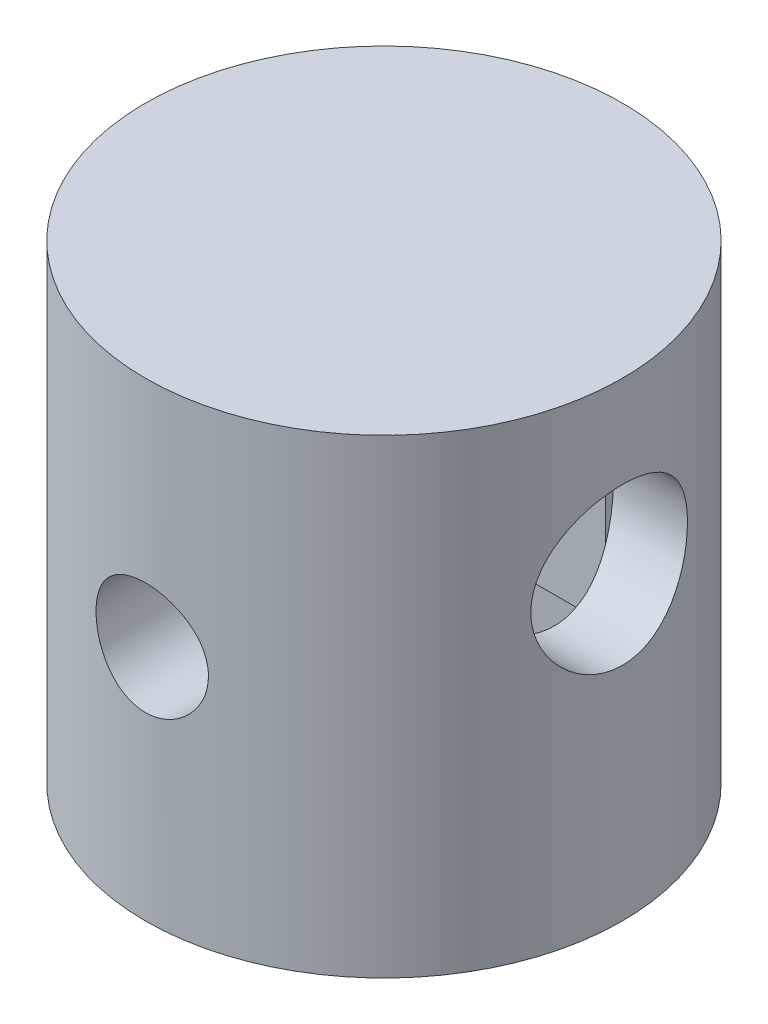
ISO-10303-21;
HEADER;
FILE_DESCRIPTION(('STEP AP214'),'2;1');
FILE_NAME('part.step','',(''),(''),'','','');
FILE_SCHEMA(('AUTOMOTIVE_DESIGN { 1 0 10303 214 1 1 1 1 }'));
ENDSEC;
DATA;
#1=APPLICATION_CONTEXT('core data for automotive mechanical design processes');
#2=APPLICATION_PROTOCOL_DEFINITION('international standard','automotive_design',2000,#1);
#3=PRODUCT_CONTEXT('',#1,'mechanical');
#4=PRODUCT('Part','Part','',(#3));
#5=PRODUCT_RELATED_PRODUCT_CATEGORY('part','',(#4));
#6=PRODUCT_DEFINITION_FORMATION('','',#4);
#7=PRODUCT_DEFINITION_CONTEXT('part definition',#1,'design');
#8=PRODUCT_DEFINITION('design','',#6,#7);
#9=PRODUCT_DEFINITION_SHAPE('','',#8);
#10=(LENGTH_UNIT() NAMED_UNIT(*) SI_UNIT(.MILLI.,.METRE.));
#11=(NAMED_UNIT(*) PLANE_ANGLE_UNIT() SI_UNIT($,.RADIAN.));
#12=(NAMED_UNIT(*) SI_UNIT($,.STERADIAN.) SOLID_ANGLE_UNIT());
#13=UNCERTAINTY_MEASURE_WITH_UNIT(LENGTH_MEASURE(1.E-05),#10,'distance_accuracy_value','');
#14=(GEOMETRIC_REPRESENTATION_CONTEXT(3) GLOBAL_UNCERTAINTY_ASSIGNED_CONTEXT((#13)) GLOBAL_UNIT_ASSIGNED_CONTEXT((#10,
#11,#12)) REPRESENTATION_CONTEXT('',''));
#15=CARTESIAN_POINT('',(0.,0.,0.));
#16=DIRECTION('',(0.,0.,1.));
#17=DIRECTION('',(1.,0.,0.));
#18=AXIS2_PLACEMENT_3D('',#15,#16,#17);
#19=CARTESIAN_POINT('',(0.,0.,0.));
#20=DIRECTION('',(0.,-1.,0.));
#21=DIRECTION('',(0.,0.,-1.));
#22=AXIS2_PLACEMENT_3D('',#19,#20,#21);
#23=PLANE('',#22);
#24=CARTESIAN_POINT('',(0.,0.,0.));
#25=DIRECTION('',(0.,1.,0.));
#26=DIRECTION('',(0.,0.,1.));
#27=AXIS2_PLACEMENT_3D('',#24,#25,#26);
#28=CIRCLE('',#27,7.);
#29=CARTESIAN_POINT('',(0.,0.,7.));
#30=VERTEX_POINT('',#29);
#31=EDGE_CURVE('E438',#30,#30,#28,.T.);
#32=ORIENTED_EDGE('',*,*,#31,.T.);
#33=EDGE_LOOP('',(#32));
#34=FACE_BOUND('',#33,.T.);
#35=ADVANCED_FACE('F350',(#34),#23,.F.);
#36=CARTESIAN_POINT('',(0.,3.44099213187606,0.));
#37=DIRECTION('',(0.,1.,0.));
#38=DIRECTION('',(0.,0.,1.));
#39=AXIS2_PLACEMENT_3D('',#36,#37,#38);
#40=CYLINDRICAL_SURFACE('',#39,7.);
#41=CARTESIAN_POINT('',(1.65,-6.85,-6.80275679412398));
#42=CARTESIAN_POINT('',(1.64999713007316,-6.75871099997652,-6.80275861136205));
#43=CARTESIAN_POINT('',(1.64239813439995,-6.66738900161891,-6.80461440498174));
#44=CARTESIAN_POINT('',(1.61224414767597,-6.48735543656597,-6.81182064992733));
#45=CARTESIAN_POINT('',(1.58967946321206,-6.39864560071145,-6.81717336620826));
#46=CARTESIAN_POINT('',(1.53035515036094,-6.22646648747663,-6.83073431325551));
#47=CARTESIAN_POINT('',(1.49361254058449,-6.1429910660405,-6.83893911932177));
#48=CARTESIAN_POINT('',(1.40702581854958,-5.98338346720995,-6.85727558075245));
#49=CARTESIAN_POINT('',(1.3571815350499,-5.90725138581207,-6.86740726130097));
#50=CARTESIAN_POINT('',(1.24476461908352,-5.76300017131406,-6.88867782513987));
#51=CARTESIAN_POINT('',(1.18198309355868,-5.69504595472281,-6.89983131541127));
#52=CARTESIAN_POINT('',(1.04592427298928,-5.57052828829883,-6.92176152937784));
#53=CARTESIAN_POINT('',(0.972646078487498,-5.51396581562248,-6.93253822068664));
#54=CARTESIAN_POINT('',(0.816555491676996,-5.41317303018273,-6.95266103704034));
#55=CARTESIAN_POINT('',(0.733636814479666,-5.36910313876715,-6.96198791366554));
#56=CARTESIAN_POINT('',(0.561312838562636,-5.29558709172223,-6.97799434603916));
#57=CARTESIAN_POINT('',(0.471908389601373,-5.26613902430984,-6.98467424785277));
#58=CARTESIAN_POINT('',(0.290868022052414,-5.22322629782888,-6.99453084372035));
#59=CARTESIAN_POINT('',(0.19930177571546,-5.20948200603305,-6.99776875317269));
#60=CARTESIAN_POINT('',(0.015109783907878,-5.19749086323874,-7.00058928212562));
#61=CARTESIAN_POINT('',(-0.077515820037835,-5.19924196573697,-7.00017238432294));
#62=CARTESIAN_POINT('',(-0.259263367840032,-5.21798740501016,-6.99577641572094));
#63=CARTESIAN_POINT('',(-0.348418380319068,-5.23468011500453,-6.99186783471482));
#64=CARTESIAN_POINT('',(-0.52262462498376,-5.28235207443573,-6.98100889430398));
#65=CARTESIAN_POINT('',(-0.6076756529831,-5.31333203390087,-6.97405838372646));
#66=CARTESIAN_POINT('',(-0.772074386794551,-5.38895377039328,-6.95778608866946));
#67=CARTESIAN_POINT('',(-0.851369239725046,-5.43370617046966,-6.94844521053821));
#68=CARTESIAN_POINT('',(-1.00143136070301,-5.53551922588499,-6.92841069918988));
#69=CARTESIAN_POINT('',(-1.07219729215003,-5.59258180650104,-6.91771685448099));
#70=CARTESIAN_POINT('',(-1.20498965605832,-5.719024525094,-6.89584251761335));
#71=CARTESIAN_POINT('',(-1.26676421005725,-5.78866849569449,-6.88465650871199));
#72=CARTESIAN_POINT('',(-1.37780936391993,-5.9374443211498,-6.86329717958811));
#73=CARTESIAN_POINT('',(-1.42707950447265,-6.01657652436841,-6.85312389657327));
#74=CARTESIAN_POINT('',(-1.51185477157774,-6.18253525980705,-6.83492437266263));
#75=CARTESIAN_POINT('',(-1.54730546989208,-6.26939059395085,-6.82690665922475));
#76=CARTESIAN_POINT('',(-1.6030277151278,-6.44806127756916,-6.8140390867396));
#77=CARTESIAN_POINT('',(-1.62330210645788,-6.53987569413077,-6.80918863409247));
#78=CARTESIAN_POINT('',(-1.64769127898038,-6.72353855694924,-6.80332774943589));
#79=CARTESIAN_POINT('',(-1.65217579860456,-6.81533515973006,-6.80222947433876));
#80=CARTESIAN_POINT('',(-1.64586488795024,-6.99836457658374,-6.80375919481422));
#81=CARTESIAN_POINT('',(-1.63507069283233,-7.08959743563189,-6.80638688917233));
#82=CARTESIAN_POINT('',(-1.59883140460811,-7.26757745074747,-6.81498886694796));
#83=CARTESIAN_POINT('',(-1.57359604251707,-7.35436984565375,-6.82091521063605));
#84=CARTESIAN_POINT('',(-1.50942069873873,-7.52249368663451,-6.83540229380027));
#85=CARTESIAN_POINT('',(-1.47047923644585,-7.60382454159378,-6.84396331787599));
#86=CARTESIAN_POINT('',(-1.37920410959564,-7.76029905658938,-6.86294389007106));
#87=CARTESIAN_POINT('',(-1.32664621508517,-7.83530818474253,-6.87339357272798));
#88=CARTESIAN_POINT('',(-1.20991829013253,-7.97557800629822,-6.89489755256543));
#89=CARTESIAN_POINT('',(-1.14574657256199,-8.04083728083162,-6.90595193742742));
#90=CARTESIAN_POINT('',(-1.00592681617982,-8.16122298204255,-6.92771364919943));
#91=CARTESIAN_POINT('',(-0.930057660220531,-8.21609535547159,-6.93840801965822));
#92=CARTESIAN_POINT('',(-0.769965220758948,-8.3123180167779,-6.95799159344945));
#93=CARTESIAN_POINT('',(-0.68574235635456,-8.35366898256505,-6.96688088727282));
#94=CARTESIAN_POINT('',(-0.511894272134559,-8.42133783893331,-6.98179887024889));
#95=CARTESIAN_POINT('',(-0.422310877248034,-8.44775867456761,-6.98784709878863));
#96=CARTESIAN_POINT('',(-0.23981620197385,-8.48513286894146,-6.99648655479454));
#97=CARTESIAN_POINT('',(-0.146905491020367,-8.49608886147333,-6.99907837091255));
#98=CARTESIAN_POINT('',(0.0372082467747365,-8.50208813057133,-7.00049202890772));
#99=CARTESIAN_POINT('',(0.128398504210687,-8.49750832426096,-6.9994031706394));
#100=CARTESIAN_POINT('',(0.308670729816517,-8.47341975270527,-6.99377268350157));
#101=CARTESIAN_POINT('',(0.39775274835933,-8.45391134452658,-6.98923113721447));
#102=CARTESIAN_POINT('',(0.570933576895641,-8.40071176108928,-6.97721604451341));
#103=CARTESIAN_POINT('',(0.655052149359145,-8.36708187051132,-6.96975517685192));
#104=CARTESIAN_POINT('',(0.81649879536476,-8.2866509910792,-6.95269208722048));
#105=CARTESIAN_POINT('',(0.893826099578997,-8.23984851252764,-6.94308962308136));
#106=CARTESIAN_POINT('',(1.04130725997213,-8.13321390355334,-6.92252474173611));
#107=CARTESIAN_POINT('',(1.11126948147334,-8.07312153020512,-6.91153737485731));
#108=CARTESIAN_POINT('',(1.24024523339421,-7.94212760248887,-6.88956325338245));
#109=CARTESIAN_POINT('',(1.29925605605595,-7.87122338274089,-6.8785764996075));
#110=CARTESIAN_POINT('',(1.40557849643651,-7.71924540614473,-6.85764827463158));
#111=CARTESIAN_POINT('',(1.45268661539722,-7.6380263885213,-6.84772646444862));
#112=CARTESIAN_POINT('',(1.53250931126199,-7.46860266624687,-6.83030721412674));
#113=CARTESIAN_POINT('',(1.56523518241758,-7.38040350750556,-6.82280787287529));
#114=CARTESIAN_POINT('',(1.61002842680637,-7.21853084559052,-6.81235745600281));
#115=CARTESIAN_POINT('',(1.62498700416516,-7.14568399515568,-6.80878274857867));
#116=CARTESIAN_POINT('',(1.64497362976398,-6.99856531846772,-6.8039817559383));
#117=CARTESIAN_POINT('',(1.65000233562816,-6.92429358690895,-6.80275531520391));
#118=CARTESIAN_POINT('',(1.65,-6.85,-6.80275679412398));
#119=B_SPLINE_CURVE_WITH_KNOTS('',3,(#41,#42,#43,#44,#45,#46,#47,#48,#49,#50,#51,#52,#53,#54,
#55,#56,#57,#58,#59,#60,#61,#62,#63,#64,#65,#66,#67,#68,#69,#70,#71,#72,#73,#74,#75,#76,#77,#78,
#79,#80,#81,#82,#83,#84,#85,#86,#87,#88,#89,#90,#91,#92,#93,#94,#95,#96,#97,#98,#99,#100,#101,
#102,#103,#104,#105,#106,#107,#108,#109,#110,#111,#112,#113,#114,#115,#116,#117,#118),
.UNSPECIFIED.,.T.,.F.,(4,2,2,2,2,2,2,2,2,2,2,2,2,2,2,2,2,2,2,2,2,2,2,2,2,2,2,2,2,2,2,2,2,2,2,2,
2,2,4),(0.,0.273594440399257,0.547366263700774,0.820810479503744,1.0942582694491,
1.37252656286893,1.65081871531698,1.9325374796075,2.21421939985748,2.49080324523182,
2.76735056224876,3.03843805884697,3.30953902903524,3.5828770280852,3.85625780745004,
4.13623055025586,4.41621357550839,4.69728844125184,4.97831061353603,5.25270687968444,
5.52708096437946,5.79756789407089,6.06808405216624,6.34337456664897,6.61870510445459,
6.90008328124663,7.18144734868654,7.46084693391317,7.74019892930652,8.01282246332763,
8.28543947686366,8.55688541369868,8.82836206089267,9.1057183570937,9.38314313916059,
9.66503130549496,9.94669771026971,10.1693714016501,10.3920303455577),.UNSPECIFIED.);
#120=CARTESIAN_POINT('',(1.65,-6.85,-6.80275679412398));
#121=VERTEX_POINT('',#120);
#122=EDGE_CURVE('E593',#121,#121,#119,.T.);
#123=ORIENTED_EDGE('',*,*,#122,.T.);
#124=EDGE_LOOP('',(#123));
#125=FACE_BOUND('',#124,.T.);
#126=CARTESIAN_POINT('',(0.,-8.5,7.));
#127=CARTESIAN_POINT('',(-0.0913287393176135,-8.49999715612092,6.99999836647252));
#128=CARTESIAN_POINT('',(-0.182690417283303,-8.49239176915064,6.99819467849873));
#129=CARTESIAN_POINT('',(-0.362806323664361,-8.46221009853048,6.9911739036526));
#130=CARTESIAN_POINT('',(-0.451558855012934,-8.43962428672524,6.98595464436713));
#131=CARTESIAN_POINT('',(-0.623828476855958,-8.38023822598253,6.97268218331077));
#132=CARTESIAN_POINT('',(-0.707351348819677,-8.34345400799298,6.96463217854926));
#133=CARTESIAN_POINT('',(-0.867039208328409,-8.25676915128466,6.9465609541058));
#134=CARTESIAN_POINT('',(-0.943204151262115,-8.20686843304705,6.93653972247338));
#135=CARTESIAN_POINT('',(-1.08742143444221,-8.09439317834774,6.91541181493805));
#136=CARTESIAN_POINT('',(-1.15531854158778,-8.03162244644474,6.90428991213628));
#137=CARTESIAN_POINT('',(-1.27972508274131,-7.89560959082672,6.88231817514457));
#138=CARTESIAN_POINT('',(-1.33623336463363,-7.82236640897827,6.87146836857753));
#139=CARTESIAN_POINT('',(-1.43696684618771,-7.66630963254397,6.85111743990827));
#140=CARTESIAN_POINT('',(-1.48102236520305,-7.58338374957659,6.84163573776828));
#141=CARTESIAN_POINT('',(-1.55450989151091,-7.41104427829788,6.8253150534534));
#142=CARTESIAN_POINT('',(-1.58394395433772,-7.32163160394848,6.81847569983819));
#143=CARTESIAN_POINT('',(-1.62683125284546,-7.14055302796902,6.80836995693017));
#144=CARTESIAN_POINT('',(-1.64056162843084,-7.04895629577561,6.80504168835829));
#145=CARTESIAN_POINT('',(-1.65251435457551,-6.86470364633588,6.80214944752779));
#146=CARTESIAN_POINT('',(-1.65073893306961,-6.77204788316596,6.80258493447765));
#147=CARTESIAN_POINT('',(-1.63195247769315,-6.59040081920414,6.80711518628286));
#148=CARTESIAN_POINT('',(-1.61526770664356,-6.50137352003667,6.81113158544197));
#149=CARTESIAN_POINT('',(-1.56765494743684,-6.32741848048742,6.82224669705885));
#150=CARTESIAN_POINT('',(-1.53672604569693,-6.24249100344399,6.82934560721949));
#151=CARTESIAN_POINT('',(-1.46121486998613,-6.07825160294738,6.84590028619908));
#152=CARTESIAN_POINT('',(-1.41651088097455,-5.99899783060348,6.85537691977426));
#153=CARTESIAN_POINT('',(-1.31480384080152,-5.84899787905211,6.87560701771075));
#154=CARTESIAN_POINT('',(-1.25779885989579,-5.77825303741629,6.88636068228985));
#155=CARTESIAN_POINT('',(-1.13140044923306,-5.64540520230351,6.90826612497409));
#156=CARTESIAN_POINT('',(-1.06173067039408,-5.58356537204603,6.91942110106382));
#157=CARTESIAN_POINT('',(-0.912878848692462,-5.47240035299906,6.940626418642));
#158=CARTESIAN_POINT('',(-0.833696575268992,-5.42307546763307,6.95067673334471));
#159=CARTESIAN_POINT('',(-0.667717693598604,-5.33825897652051,6.9685816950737));
#160=CARTESIAN_POINT('',(-0.580900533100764,-5.30280620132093,6.97643016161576));
#161=CARTESIAN_POINT('',(-0.402313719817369,-5.24706844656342,6.98900179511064));
#162=CARTESIAN_POINT('',(-0.310544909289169,-5.22678089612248,6.99372549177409));
#163=CARTESIAN_POINT('',(-0.126913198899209,-5.20234231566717,6.99943837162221));
#164=CARTESIAN_POINT('',(-0.0351005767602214,-5.19783240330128,7.00051059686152));
#165=CARTESIAN_POINT('',(0.147966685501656,-5.20409827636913,6.99903444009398));
#166=CARTESIAN_POINT('',(0.239221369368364,-5.21487284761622,6.99648634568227));
#167=CARTESIAN_POINT('',(0.417362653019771,-5.25110507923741,6.98810869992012));
#168=CARTESIAN_POINT('',(0.504290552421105,-5.27637051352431,6.98232213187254));
#169=CARTESIAN_POINT('',(0.672672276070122,-5.34065065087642,6.96811723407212));
#170=CARTESIAN_POINT('',(0.754125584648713,-5.3796666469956,6.9596986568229));
#171=CARTESIAN_POINT('',(0.910700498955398,-5.47106042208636,6.94096161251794));
#172=CARTESIAN_POINT('',(0.985698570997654,-5.52364386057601,6.93061465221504));
#173=CARTESIAN_POINT('',(1.1259344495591,-5.64041331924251,6.90921937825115));
#174=CARTESIAN_POINT('',(1.19117076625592,-5.70460110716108,6.89817095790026));
#175=CARTESIAN_POINT('',(1.31148229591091,-5.84441505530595,6.87632466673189));
#176=CARTESIAN_POINT('',(1.36630717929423,-5.92025861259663,6.865537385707));
#177=CARTESIAN_POINT('',(1.46244648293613,-6.08028479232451,6.84570445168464));
#178=CARTESIAN_POINT('',(1.50376150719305,-6.16446704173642,6.83665872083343));
#179=CARTESIAN_POINT('',(1.57141076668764,-6.33832127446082,6.82142736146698));
#180=CARTESIAN_POINT('',(1.59783286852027,-6.42795752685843,6.81522499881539));
#181=CARTESIAN_POINT('',(1.63519178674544,-6.61056565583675,6.80635903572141));
#182=CARTESIAN_POINT('',(1.64613154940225,-6.70353689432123,6.80369476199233));
#183=CARTESIAN_POINT('',(1.65207449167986,-6.88764007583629,6.80225382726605));
#184=CARTESIAN_POINT('',(1.6474761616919,-6.97875861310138,6.8033799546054));
#185=CARTESIAN_POINT('',(1.62337546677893,-7.15888236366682,6.80917049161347));
#186=CARTESIAN_POINT('',(1.60387333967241,-7.24788761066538,6.81383484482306));
#187=CARTESIAN_POINT('',(1.55072477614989,-7.42088010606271,6.82612522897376));
#188=CARTESIAN_POINT('',(1.51714519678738,-7.50488895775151,6.83373724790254));
#189=CARTESIAN_POINT('',(1.43684939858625,-7.66613651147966,6.85106877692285));
#190=CARTESIAN_POINT('',(1.39013156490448,-7.74337437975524,6.86078854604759));
#191=CARTESIAN_POINT('',(1.28360204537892,-7.89083165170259,6.88152384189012));
#192=CARTESIAN_POINT('',(1.22351026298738,-7.96084523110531,6.89256431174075));
#193=CARTESIAN_POINT('',(1.09249493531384,-8.0899248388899,6.91453965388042));
#194=CARTESIAN_POINT('',(1.02156885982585,-8.1489883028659,6.92547450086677));
#195=CARTESIAN_POINT('',(0.869562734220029,-8.25538285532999,6.9462096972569));
#196=CARTESIAN_POINT('',(0.788341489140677,-8.30251645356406,6.95598967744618));
#197=CARTESIAN_POINT('',(0.618909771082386,-8.38238620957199,6.97310375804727));
#198=CARTESIAN_POINT('',(0.530704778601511,-8.41513352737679,6.98043975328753));
#199=CARTESIAN_POINT('',(0.368778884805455,-8.45997422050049,6.99064750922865));
#200=CARTESIAN_POINT('',(0.295881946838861,-8.47495329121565,6.99413174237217));
#201=CARTESIAN_POINT('',(0.14866389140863,-8.49496704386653,6.99880858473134));
#202=CARTESIAN_POINT('',(0.0743428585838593,-8.50000231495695,7.00000132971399));
#203=CARTESIAN_POINT('',(0.,-8.5,7.));
#204=B_SPLINE_CURVE_WITH_KNOTS('',3,(#126,#127,#128,#129,#130,#131,#132,#133,#134,#135,#136,
#137,#138,#139,#140,#141,#142,#143,#144,#145,#146,#147,#148,#149,#150,#151,#152,#153,#154,#155,
#156,#157,#158,#159,#160,#161,#162,#163,#164,#165,#166,#167,#168,#169,#170,#171,#172,#173,#174,
#175,#176,#177,#178,#179,#180,#181,#182,#183,#184,#185,#186,#187,#188,#189,#190,#191,#192,#193,
#194,#195,#196,#197,#198,#199,#200,#201,#202,#203),.UNSPECIFIED.,.T.,.F.,(4,2,2,2,2,2,2,2,2,2,2,
2,2,2,2,2,2,2,2,2,2,2,2,2,2,2,2,2,2,2,2,2,2,2,2,2,2,2,4),(0.,0.273713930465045,
0.547602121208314,0.82118197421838,1.09476348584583,1.37287554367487,1.65101572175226,
1.93278083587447,2.21450632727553,2.49117922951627,2.76781237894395,3.0385362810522,
3.30927754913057,3.58248319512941,3.85573173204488,4.13587649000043,4.41602803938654,
4.69695826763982,4.97784086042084,5.25229133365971,5.52672000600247,5.79758981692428,
6.06848510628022,6.34375631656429,6.61906949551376,6.90033819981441,7.18159432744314,
7.46117322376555,7.74069890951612,8.01311084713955,8.28551843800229,8.55664670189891,
8.82780830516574,9.10529722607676,9.38285105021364,9.66473658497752,9.94640306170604,
10.1692231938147,10.3920301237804),.UNSPECIFIED.);
#205=CARTESIAN_POINT('',(0.,-8.5,7.));
#206=VERTEX_POINT('',#205);
#207=EDGE_CURVE('E556',#206,#206,#204,.T.);
#208=ORIENTED_EDGE('',*,*,#207,.T.);
#209=EDGE_LOOP('',(#208));
#210=FACE_BOUND('',#209,.T.);
#211=CARTESIAN_POINT('',(-6.61135387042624,-5.,-2.3));
#212=CARTESIAN_POINT('',(-6.61135376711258,-4.8746101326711,-2.30000023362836));
#213=CARTESIAN_POINT('',(-6.61496005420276,-4.74922095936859,-2.28971141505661));
#214=CARTESIAN_POINT('',(-6.62892325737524,-4.50215017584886,-2.24896182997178));
#215=CARTESIAN_POINT('',(-6.63928144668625,-4.38046926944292,-2.2184972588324));
#216=CARTESIAN_POINT('',(-6.66545129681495,-4.14443299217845,-2.13857592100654));
#217=CARTESIAN_POINT('',(-6.68125250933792,-4.030064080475,-2.0891555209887));
#218=CARTESIAN_POINT('',(-6.71651296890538,-3.81120485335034,-1.97284893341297));
#219=CARTESIAN_POINT('',(-6.73597298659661,-3.70671662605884,-1.90595906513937));
#220=CARTESIAN_POINT('',(-6.7771878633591,-3.50661365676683,-1.75388928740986));
#221=CARTESIAN_POINT('',(-6.79899872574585,-3.41142930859,-1.66815807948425));
#222=CARTESIAN_POINT('',(-6.84198364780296,-3.23649668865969,-1.48201649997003));
#223=CARTESIAN_POINT('',(-6.86315760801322,-3.1567508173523,-1.38160384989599));
#224=CARTESIAN_POINT('',(-6.90312958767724,-3.01301854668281,-1.1658151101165));
#225=CARTESIAN_POINT('',(-6.92185404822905,-2.94948129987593,-1.05012502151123));
#226=CARTESIAN_POINT('',(-6.95415879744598,-2.84293834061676,-0.808978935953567));
#227=CARTESIAN_POINT('',(-6.96774043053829,-2.79992726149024,-0.683525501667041));
#228=CARTESIAN_POINT('',(-6.98783262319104,-2.73711182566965,-0.430925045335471));
#229=CARTESIAN_POINT('',(-6.99456717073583,-2.71657056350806,-0.303979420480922));
#230=CARTESIAN_POINT('',(-7.00100054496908,-2.69693669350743,-0.0482766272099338));
#231=CARTESIAN_POINT('',(-7.00070113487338,-2.69783871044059,0.0804800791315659));
#232=CARTESIAN_POINT('',(-6.99325309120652,-2.72059432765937,0.330941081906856));
#233=CARTESIAN_POINT('',(-6.98636600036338,-2.74164789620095,0.45272710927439));
#234=CARTESIAN_POINT('',(-6.96684323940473,-2.80278838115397,0.69093014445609));
#235=CARTESIAN_POINT('',(-6.9542071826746,-2.84287657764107,0.807346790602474));
#236=CARTESIAN_POINT('',(-6.92426903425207,-2.94142629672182,1.03327820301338));
#237=CARTESIAN_POINT('',(-6.90690864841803,-3.00011898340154,1.14268409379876));
#238=CARTESIAN_POINT('',(-6.86933407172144,-3.13402231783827,1.35033346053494));
#239=CARTESIAN_POINT('',(-6.84911910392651,-3.20923746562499,1.44857388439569));
#240=CARTESIAN_POINT('',(-6.80687784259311,-3.3781000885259,1.63586555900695));
#241=CARTESIAN_POINT('',(-6.78481099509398,-3.47243428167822,1.72428941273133));
#242=CARTESIAN_POINT('',(-6.74213838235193,-3.67478471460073,1.88426161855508));
#243=CARTESIAN_POINT('',(-6.72153282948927,-3.78280293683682,1.95580752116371));
#244=CARTESIAN_POINT('',(-6.6838978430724,-4.01139265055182,2.08082842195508));
#245=CARTESIAN_POINT('',(-6.66692046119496,-4.13211396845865,2.13404633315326));
#246=CARTESIAN_POINT('',(-6.63906839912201,-4.38150129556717,2.21918929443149));
#247=CARTESIAN_POINT('',(-6.62819124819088,-4.51016406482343,2.25112296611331));
#248=CARTESIAN_POINT('',(-6.61432780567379,-4.76572001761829,2.29152931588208));
#249=CARTESIAN_POINT('',(-6.61101553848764,-4.89244219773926,2.30097196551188));
#250=CARTESIAN_POINT('',(-6.61174714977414,-5.14567752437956,2.29887008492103));
#251=CARTESIAN_POINT('',(-6.61578974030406,-5.27219070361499,2.28732922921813));
#252=CARTESIAN_POINT('',(-6.63045131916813,-5.51706031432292,2.24445845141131));
#253=CARTESIAN_POINT('',(-6.64084856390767,-5.63554813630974,2.21379509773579));
#254=CARTESIAN_POINT('',(-6.66680610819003,-5.86567565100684,2.13434555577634));
#255=CARTESIAN_POINT('',(-6.68236730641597,-5.97731414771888,2.08555621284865));
#256=CARTESIAN_POINT('',(-6.71749765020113,-6.19441156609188,1.96951736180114));
#257=CARTESIAN_POINT('',(-6.73717617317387,-6.2995712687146,1.90174204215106));
#258=CARTESIAN_POINT('',(-6.77810837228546,-6.49737641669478,1.7502551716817));
#259=CARTESIAN_POINT('',(-6.79936249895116,-6.59001826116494,1.66653905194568));
#260=CARTESIAN_POINT('',(-6.84224753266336,-6.7646113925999,1.48091911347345));
#261=CARTESIAN_POINT('',(-6.86384995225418,-6.84586463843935,1.37835025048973));
#262=CARTESIAN_POINT('',(-6.90401911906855,-6.99004708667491,1.1605040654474));
#263=CARTESIAN_POINT('',(-6.92258598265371,-7.05297699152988,1.04522723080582));
#264=CARTESIAN_POINT('',(-6.95450026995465,-7.15814196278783,0.805847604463));
#265=CARTESIAN_POINT('',(-6.96788262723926,-7.20051604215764,0.681810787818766));
#266=CARTESIAN_POINT('',(-6.98807162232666,-7.26363662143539,0.427847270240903));
#267=CARTESIAN_POINT('',(-6.99488055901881,-7.28439068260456,0.297922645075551));
#268=CARTESIAN_POINT('',(-7.00098692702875,-7.3030167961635,0.0422656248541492));
#269=CARTESIAN_POINT('',(-7.00061377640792,-7.30189231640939,-0.0833866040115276));
#270=CARTESIAN_POINT('',(-6.9932038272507,-7.27925722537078,-0.332628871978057));
#271=CARTESIAN_POINT('',(-6.98616754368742,-7.25774818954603,-0.456219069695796));
#272=CARTESIAN_POINT('',(-6.96633897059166,-7.19561441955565,-0.695980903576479));
#273=CARTESIAN_POINT('',(-6.95363497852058,-7.15528249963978,-0.812236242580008));
#274=CARTESIAN_POINT('',(-6.92377928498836,-7.05691723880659,-1.03637766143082));
#275=CARTESIAN_POINT('',(-6.90662678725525,-6.99888072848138,-1.14426223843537));
#276=CARTESIAN_POINT('',(-6.86887214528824,-6.86432720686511,-1.3528649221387));
#277=CARTESIAN_POINT('',(-6.84816742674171,-6.78721612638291,-1.45318104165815));
#278=CARTESIAN_POINT('',(-6.80590156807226,-6.61772148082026,-1.63977868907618));
#279=CARTESIAN_POINT('',(-6.78434016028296,-6.52533311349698,-1.72605578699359));
#280=CARTESIAN_POINT('',(-6.74182667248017,-6.32373711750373,-1.88542881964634));
#281=CARTESIAN_POINT('',(-6.7209282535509,-6.21402651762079,-1.95790480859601));
#282=CARTESIAN_POINT('',(-6.68311605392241,-5.98333640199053,-2.08333215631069));
#283=CARTESIAN_POINT('',(-6.66620109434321,-5.8623602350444,-2.13628929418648));
#284=CARTESIAN_POINT('',(-6.63926096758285,-5.61931717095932,-2.21855674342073));
#285=CARTESIAN_POINT('',(-6.62891004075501,-5.49767048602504,-2.24900030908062));
#286=CARTESIAN_POINT('',(-6.61495762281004,-5.25068150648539,-2.28971859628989));
#287=CARTESIAN_POINT('',(-6.61135397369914,-5.12534040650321,-2.2999997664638));
#288=CARTESIAN_POINT('',(-6.61135387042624,-5.,-2.3));
#289=B_SPLINE_CURVE_WITH_KNOTS('',3,(#211,#212,#213,#214,#215,#216,#217,#218,#219,#220,#221,
#222,#223,#224,#225,#226,#227,#228,#229,#230,#231,#232,#233,#234,#235,#236,#237,#238,#239,#240,
#241,#242,#243,#244,#245,#246,#247,#248,#249,#250,#251,#252,#253,#254,#255,#256,#257,#258,#259,
#260,#261,#262,#263,#264,#265,#266,#267,#268,#269,#270,#271,#272,#273,#274,#275,#276,#277,#278,
#279,#280,#281,#282,#283,#284,#285,#286,#287,#288),.UNSPECIFIED.,.T.,.F.,(4,2,2,2,2,2,2,2,2,2,2,
2,2,2,2,2,2,2,2,2,2,2,2,2,2,2,2,2,2,2,2,2,2,2,2,2,2,2,4),(0.,0.375705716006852,
0.751482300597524,1.12654153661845,1.50167985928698,1.88975792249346,2.27789627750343,
2.67584263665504,3.07368489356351,3.45804762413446,3.84231400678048,4.21193130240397,
4.58157345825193,4.95600146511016,5.33053157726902,5.7222246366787,6.11397450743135,
6.51101477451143,6.90789411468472,7.28732015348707,7.66667975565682,8.03350274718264,
8.40038961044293,8.77866025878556,9.15703948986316,9.5530254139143,9.9489961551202,
10.3422503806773,10.7353670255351,11.1104975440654,11.4855990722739,11.8550505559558,
12.2245682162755,12.6074916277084,12.9905356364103,13.3880280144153,13.7854026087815,
14.1610802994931,14.5366378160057),.UNSPECIFIED.);
#290=CARTESIAN_POINT('',(-6.61135387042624,-5.,-2.3));
#291=VERTEX_POINT('',#290);
#292=EDGE_CURVE('E578',#291,#291,#289,.T.);
#293=ORIENTED_EDGE('',*,*,#292,.T.);
#294=EDGE_LOOP('',(#293));
#295=FACE_BOUND('',#294,.T.);
#296=CARTESIAN_POINT('',(6.61135387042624,-5.,-2.3));
#297=CARTESIAN_POINT('',(6.61135376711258,-5.1253898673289,-2.30000023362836));
#298=CARTESIAN_POINT('',(6.61496005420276,-5.25077904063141,-2.28971141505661));
#299=CARTESIAN_POINT('',(6.62892325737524,-5.49784982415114,-2.24896182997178));
#300=CARTESIAN_POINT('',(6.63928144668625,-5.61953073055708,-2.2184972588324));
#301=CARTESIAN_POINT('',(6.66545129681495,-5.85556700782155,-2.13857592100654));
#302=CARTESIAN_POINT('',(6.68125250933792,-5.96993591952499,-2.0891555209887));
#303=CARTESIAN_POINT('',(6.71651296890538,-6.18879514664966,-1.97284893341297));
#304=CARTESIAN_POINT('',(6.73597298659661,-6.29328337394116,-1.90595906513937));
#305=CARTESIAN_POINT('',(6.7771878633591,-6.49338634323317,-1.75388928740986));
#306=CARTESIAN_POINT('',(6.79899872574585,-6.58857069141,-1.66815807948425));
#307=CARTESIAN_POINT('',(6.84198364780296,-6.76350331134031,-1.48201649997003));
#308=CARTESIAN_POINT('',(6.86315760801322,-6.8432491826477,-1.38160384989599));
#309=CARTESIAN_POINT('',(6.90312958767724,-6.98698145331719,-1.1658151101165));
#310=CARTESIAN_POINT('',(6.92185404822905,-7.05051870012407,-1.05012502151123));
#311=CARTESIAN_POINT('',(6.95415879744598,-7.15706165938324,-0.808978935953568));
#312=CARTESIAN_POINT('',(6.96774043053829,-7.20007273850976,-0.683525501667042));
#313=CARTESIAN_POINT('',(6.98783262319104,-7.26288817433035,-0.430925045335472));
#314=CARTESIAN_POINT('',(6.99456717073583,-7.28342943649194,-0.303979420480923));
#315=CARTESIAN_POINT('',(7.00100054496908,-7.30306330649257,-0.0482766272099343));
#316=CARTESIAN_POINT('',(7.00070113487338,-7.30216128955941,0.0804800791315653));
#317=CARTESIAN_POINT('',(6.99325309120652,-7.27940567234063,0.330941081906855));
#318=CARTESIAN_POINT('',(6.98636600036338,-7.25835210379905,0.45272710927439));
#319=CARTESIAN_POINT('',(6.96684323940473,-7.19721161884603,0.69093014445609));
#320=CARTESIAN_POINT('',(6.9542071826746,-7.15712342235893,0.807346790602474));
#321=CARTESIAN_POINT('',(6.92426903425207,-7.05857370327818,1.03327820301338));
#322=CARTESIAN_POINT('',(6.90690864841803,-6.99988101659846,1.14268409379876));
#323=CARTESIAN_POINT('',(6.86933407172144,-6.86597768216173,1.35033346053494));
#324=CARTESIAN_POINT('',(6.84911910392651,-6.79076253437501,1.44857388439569));
#325=CARTESIAN_POINT('',(6.80687784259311,-6.6218999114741,1.63586555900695));
#326=CARTESIAN_POINT('',(6.78481099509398,-6.52756571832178,1.72428941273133));
#327=CARTESIAN_POINT('',(6.74213838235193,-6.32521528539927,1.88426161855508));
#328=CARTESIAN_POINT('',(6.72153282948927,-6.21719706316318,1.95580752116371));
#329=CARTESIAN_POINT('',(6.6838978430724,-5.98860734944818,2.08082842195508));
#330=CARTESIAN_POINT('',(6.66692046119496,-5.86788603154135,2.13404633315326));
#331=CARTESIAN_POINT('',(6.63906839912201,-5.61849870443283,2.21918929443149));
#332=CARTESIAN_POINT('',(6.62819124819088,-5.48983593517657,2.25112296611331));
#333=CARTESIAN_POINT('',(6.61432780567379,-5.23427998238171,2.29152931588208));
#334=CARTESIAN_POINT('',(6.61101553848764,-5.10755780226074,2.30097196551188));
#335=CARTESIAN_POINT('',(6.61174714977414,-4.85432247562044,2.29887008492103));
#336=CARTESIAN_POINT('',(6.61578974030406,-4.72780929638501,2.28732922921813));
#337=CARTESIAN_POINT('',(6.63045131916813,-4.48293968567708,2.2444584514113));
#338=CARTESIAN_POINT('',(6.64084856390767,-4.36445186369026,2.21379509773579));
#339=CARTESIAN_POINT('',(6.66680610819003,-4.13432434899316,2.13434555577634));
#340=CARTESIAN_POINT('',(6.68236730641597,-4.02268585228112,2.08555621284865));
#341=CARTESIAN_POINT('',(6.71749765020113,-3.80558843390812,1.96951736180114));
#342=CARTESIAN_POINT('',(6.73717617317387,-3.7004287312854,1.90174204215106));
#343=CARTESIAN_POINT('',(6.77810837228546,-3.50262358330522,1.7502551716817));
#344=CARTESIAN_POINT('',(6.79936249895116,-3.40998173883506,1.66653905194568));
#345=CARTESIAN_POINT('',(6.84224753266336,-3.2353886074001,1.48091911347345));
#346=CARTESIAN_POINT('',(6.86384995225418,-3.15413536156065,1.37835025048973));
#347=CARTESIAN_POINT('',(6.90401911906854,-3.00995291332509,1.1605040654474));
#348=CARTESIAN_POINT('',(6.92258598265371,-2.94702300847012,1.04522723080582));
#349=CARTESIAN_POINT('',(6.95450026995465,-2.84185803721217,0.805847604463));
#350=CARTESIAN_POINT('',(6.96788262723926,-2.79948395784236,0.681810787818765));
#351=CARTESIAN_POINT('',(6.98807162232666,-2.73636337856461,0.427847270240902));
#352=CARTESIAN_POINT('',(6.99488055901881,-2.71560931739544,0.297922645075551));
#353=CARTESIAN_POINT('',(7.00098692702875,-2.6969832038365,0.0422656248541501));
#354=CARTESIAN_POINT('',(7.00061377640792,-2.69810768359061,-0.0833866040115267));
#355=CARTESIAN_POINT('',(6.9932038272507,-2.72074277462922,-0.332628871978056));
#356=CARTESIAN_POINT('',(6.98616754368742,-2.74225181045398,-0.456219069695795));
#357=CARTESIAN_POINT('',(6.96633897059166,-2.80438558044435,-0.695980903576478));
#358=CARTESIAN_POINT('',(6.95363497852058,-2.84471750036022,-0.812236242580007));
#359=CARTESIAN_POINT('',(6.92377928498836,-2.94308276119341,-1.03637766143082));
#360=CARTESIAN_POINT('',(6.90662678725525,-3.00111927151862,-1.14426223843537));
#361=CARTESIAN_POINT('',(6.86887214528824,-3.13567279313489,-1.3528649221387));
#362=CARTESIAN_POINT('',(6.84816742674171,-3.21278387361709,-1.45318104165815));
#363=CARTESIAN_POINT('',(6.80590156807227,-3.38227851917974,-1.63977868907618));
#364=CARTESIAN_POINT('',(6.78434016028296,-3.47466688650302,-1.72605578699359));
#365=CARTESIAN_POINT('',(6.74182667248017,-3.67626288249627,-1.88542881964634));
#366=CARTESIAN_POINT('',(6.7209282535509,-3.78597348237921,-1.95790480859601));
#367=CARTESIAN_POINT('',(6.68311605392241,-4.01666359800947,-2.08333215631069));
#368=CARTESIAN_POINT('',(6.66620109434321,-4.1376397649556,-2.13628929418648));
#369=CARTESIAN_POINT('',(6.63926096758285,-4.38068282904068,-2.21855674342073));
#370=CARTESIAN_POINT('',(6.62891004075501,-4.50232951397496,-2.24900030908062));
#371=CARTESIAN_POINT('',(6.61495762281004,-4.74931849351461,-2.28971859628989));
#372=CARTESIAN_POINT('',(6.61135397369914,-4.87465959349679,-2.2999997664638));
#373=CARTESIAN_POINT('',(6.61135387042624,-5.,-2.3));
#374=B_SPLINE_CURVE_WITH_KNOTS('',3,(#296,#297,#298,#299,#300,#301,#302,#303,#304,#305,#306,
#307,#308,#309,#310,#311,#312,#313,#314,#315,#316,#317,#318,#319,#320,#321,#322,#323,#324,#325,
#326,#327,#328,#329,#330,#331,#332,#333,#334,#335,#336,#337,#338,#339,#340,#341,#342,#343,#344,
#345,#346,#347,#348,#349,#350,#351,#352,#353,#354,#355,#356,#357,#358,#359,#360,#361,#362,#363,
#364,#365,#366,#367,#368,#369,#370,#371,#372,#373),.UNSPECIFIED.,.T.,.F.,(4,2,2,2,2,2,2,2,2,2,2,
2,2,2,2,2,2,2,2,2,2,2,2,2,2,2,2,2,2,2,2,2,2,2,2,2,2,2,4),(0.,0.375705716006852,
0.751482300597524,1.12654153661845,1.50167985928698,1.88975792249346,2.27789627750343,
2.67584263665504,3.07368489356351,3.45804762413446,3.84231400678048,4.21193130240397,
4.58157345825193,4.95600146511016,5.33053157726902,5.7222246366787,6.11397450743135,
6.51101477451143,6.90789411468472,7.28732015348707,7.66667975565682,8.03350274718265,
8.40038961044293,8.77866025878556,9.15703948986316,9.5530254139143,9.9489961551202,
10.3422503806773,10.7353670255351,11.1104975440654,11.4855990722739,11.8550505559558,
12.2245682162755,12.6074916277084,12.9905356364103,13.3880280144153,13.7854026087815,
14.1610802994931,14.5366378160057),.UNSPECIFIED.);
#375=CARTESIAN_POINT('',(6.61135387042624,-5.,-2.3));
#376=VERTEX_POINT('',#375);
#377=EDGE_CURVE('E574',#376,#376,#374,.T.);
#378=ORIENTED_EDGE('',*,*,#377,.T.);
#379=EDGE_LOOP('',(#378));
#380=FACE_BOUND('',#379,.T.);
#381=ORIENTED_EDGE('',*,*,#31,.F.);
#382=EDGE_LOOP('',(#381));
#383=FACE_BOUND('',#382,.T.);
#384=CARTESIAN_POINT('',(0.,-13.8,0.));
#385=DIRECTION('',(0.,1.,0.));
#386=DIRECTION('',(0.,0.,1.));
#387=AXIS2_PLACEMENT_3D('',#384,#385,#386);
#388=CIRCLE('',#387,7.);
#389=CARTESIAN_POINT('',(0.,-13.8,7.));
#390=VERTEX_POINT('',#389);
#391=EDGE_CURVE('E623',#390,#390,#388,.T.);
#392=ORIENTED_EDGE('',*,*,#391,.T.);
#393=EDGE_LOOP('',(#392));
#394=FACE_BOUND('',#393,.T.);
#395=ADVANCED_FACE('F582',(#125,#210,#295,#380,#383,#394),#40,.T.);
#396=CARTESIAN_POINT('',(7.,-13.8,0.));
#397=DIRECTION('',(0.,1.,0.));
#398=DIRECTION('',(0.,0.,1.));
#399=AXIS2_PLACEMENT_3D('',#396,#397,#398);
#400=PLANE('',#399);
#401=ORIENTED_EDGE('',*,*,#391,.F.);
#402=EDGE_LOOP('',(#401));
#403=FACE_BOUND('',#402,.T.);
#404=CARTESIAN_POINT('',(0.,-13.8,0.));
#405=DIRECTION('',(0.,1.,0.));
#406=DIRECTION('',(0.,0.,1.));
#407=AXIS2_PLACEMENT_3D('',#404,#405,#406);
#408=CIRCLE('',#407,5.9);
#409=CARTESIAN_POINT('',(0.,-13.8,5.9));
#410=VERTEX_POINT('',#409);
#411=EDGE_CURVE('E625',#410,#410,#408,.T.);
#412=ORIENTED_EDGE('',*,*,#411,.T.);
#413=EDGE_LOOP('',(#412));
#414=FACE_BOUND('',#413,.T.);
#415=ADVANCED_FACE('F586',(#403,#414),#400,.F.);
#416=CARTESIAN_POINT('',(0.,3.44099213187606,0.));
#417=DIRECTION('',(0.,1.,0.));
#418=DIRECTION('',(0.,0.,1.));
#419=AXIS2_PLACEMENT_3D('',#416,#417,#418);
#420=CYLINDRICAL_SURFACE('',#419,5.9);
#421=ORIENTED_EDGE('',*,*,#411,.F.);
#422=EDGE_LOOP('',(#421));
#423=FACE_BOUND('',#422,.T.);
#424=CARTESIAN_POINT('',(0.,-10.5,0.));
#425=DIRECTION('',(0.,1.,0.));
#426=DIRECTION('',(0.,0.,1.));
#427=AXIS2_PLACEMENT_3D('',#424,#425,#426);
#428=CIRCLE('',#427,5.9);
#429=CARTESIAN_POINT('',(0.,-10.5,5.9));
#430=VERTEX_POINT('',#429);
#431=EDGE_CURVE('E630',#430,#430,#428,.T.);
#432=ORIENTED_EDGE('',*,*,#431,.T.);
#433=EDGE_LOOP('',(#432));
#434=FACE_BOUND('',#433,.T.);
#435=ADVANCED_FACE('F735',(#423,#434),#420,.F.);
#436=CARTESIAN_POINT('',(5.9,-10.5,0.));
#437=DIRECTION('',(0.,1.,0.));
#438=DIRECTION('',(0.,0.,1.));
#439=AXIS2_PLACEMENT_3D('',#436,#437,#438);
#440=PLANE('',#439);
#441=DIRECTION('',(0.,0.,1.));
#442=VECTOR('',#441,1.);
#443=CARTESIAN_POINT('',(2.50000000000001,-10.5,0.));
#444=LINE('',#443,#442);
#445=CARTESIAN_POINT('',(2.5,-10.5,4.));
#446=VERTEX_POINT('',#445);
#447=CARTESIAN_POINT('',(2.5,-10.5,4.33012701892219));
#448=VERTEX_POINT('',#447);
#449=EDGE_CURVE('E433',#446,#448,#444,.T.);
#450=ORIENTED_EDGE('',*,*,#449,.T.);
#451=CARTESIAN_POINT('',(0.,-10.5,0.));
#452=DIRECTION('',(0.,1.,0.));
#453=DIRECTION('',(0.,0.,1.));
#454=AXIS2_PLACEMENT_3D('',#451,#452,#453);
#455=CIRCLE('',#454,5.);
#456=CARTESIAN_POINT('',(2.5,-10.5,-4.33012701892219));
#457=VERTEX_POINT('',#456);
#458=EDGE_CURVE('E460',#448,#457,#455,.T.);
#459=ORIENTED_EDGE('',*,*,#458,.T.);
#460=DIRECTION('',(0.,0.,1.));
#461=VECTOR('',#460,1.);
#462=CARTESIAN_POINT('',(2.50000000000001,-10.5,0.));
#463=LINE('',#462,#461);
#464=CARTESIAN_POINT('',(2.5,-10.5,-4.));
#465=VERTEX_POINT('',#464);
#466=EDGE_CURVE('E457',#457,#465,#463,.T.);
#467=ORIENTED_EDGE('',*,*,#466,.T.);
#468=DIRECTION('',(-1.,0.,0.));
#469=VECTOR('',#468,1.);
#470=CARTESIAN_POINT('',(5.9,-10.5,-4.));
#471=LINE('',#470,#469);
#472=CARTESIAN_POINT('',(-2.5,-10.5,-4.));
#473=VERTEX_POINT('',#472);
#474=EDGE_CURVE('E454',#465,#473,#471,.T.);
#475=ORIENTED_EDGE('',*,*,#474,.T.);
#476=DIRECTION('',(0.,0.,-1.));
#477=VECTOR('',#476,1.);
#478=CARTESIAN_POINT('',(-2.5,-10.5,0.));
#479=LINE('',#478,#477);
#480=CARTESIAN_POINT('',(-2.5,-10.5,-4.33012701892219));
#481=VERTEX_POINT('',#480);
#482=EDGE_CURVE('E451',#473,#481,#479,.T.);
#483=ORIENTED_EDGE('',*,*,#482,.T.);
#484=CARTESIAN_POINT('',(0.,-10.5,0.));
#485=DIRECTION('',(0.,1.,0.));
#486=DIRECTION('',(0.,0.,1.));
#487=AXIS2_PLACEMENT_3D('',#484,#485,#486);
#488=CIRCLE('',#487,5.);
#489=CARTESIAN_POINT('',(-2.5,-10.5,4.33012701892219));
#490=VERTEX_POINT('',#489);
#491=EDGE_CURVE('E446',#481,#490,#488,.T.);
#492=ORIENTED_EDGE('',*,*,#491,.T.);
#493=DIRECTION('',(0.,0.,-1.));
#494=VECTOR('',#493,1.);
#495=CARTESIAN_POINT('',(-2.5,-10.5,0.));
#496=LINE('',#495,#494);
#497=CARTESIAN_POINT('',(-2.5,-10.5,4.));
#498=VERTEX_POINT('',#497);
#499=EDGE_CURVE('E444',#490,#498,#496,.T.);
#500=ORIENTED_EDGE('',*,*,#499,.T.);
#501=DIRECTION('',(1.,0.,0.));
#502=VECTOR('',#501,1.);
#503=CARTESIAN_POINT('',(5.9,-10.5,4.));
#504=LINE('',#503,#502);
#505=EDGE_CURVE('E425',#498,#446,#504,.T.);
#506=ORIENTED_EDGE('',*,*,#505,.T.);
#507=EDGE_LOOP('',(#450,#459,#467,#475,#483,#492,#500,#506));
#508=FACE_BOUND('',#507,.T.);
#509=ORIENTED_EDGE('',*,*,#431,.F.);
#510=EDGE_LOOP('',(#509));
#511=FACE_BOUND('',#510,.T.);
#512=ADVANCED_FACE('F440',(#508,#511),#440,.F.);
#513=CARTESIAN_POINT('',(0.,-1.3,0.));
#514=DIRECTION('',(0.,-1.,0.));
#515=DIRECTION('',(0.,0.,-1.));
#516=AXIS2_PLACEMENT_3D('',#513,#514,#515);
#517=CYLINDRICAL_SURFACE('',#516,5.);
#518=CARTESIAN_POINT('',(4.43959457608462,-5.,-2.3));
#519=CARTESIAN_POINT('',(4.43960320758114,-4.87873058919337,-2.29999229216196));
#520=CARTESIAN_POINT('',(4.44463694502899,-4.75727219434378,-2.29034635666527));
#521=CARTESIAN_POINT('',(4.46408179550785,-4.51797266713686,-2.25220031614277));
#522=CARTESIAN_POINT('',(4.47851562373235,-4.40014102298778,-2.22365453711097));
#523=CARTESIAN_POINT('',(4.5147488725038,-4.17199118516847,-2.14912420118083));
#524=CARTESIAN_POINT('',(4.53651373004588,-4.06164060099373,-2.10322135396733));
#525=CARTESIAN_POINT('',(4.58490435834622,-3.85023394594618,-1.99552627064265));
#526=CARTESIAN_POINT('',(4.61152970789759,-3.7491770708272,-1.93373541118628));
#527=CARTESIAN_POINT('',(4.66890482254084,-3.55146998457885,-1.79098738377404));
#528=CARTESIAN_POINT('',(4.69981252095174,-3.45560960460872,-1.70899924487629));
#529=CARTESIAN_POINT('',(4.76098502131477,-3.27840047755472,-1.53033862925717));
#530=CARTESIAN_POINT('',(4.7912495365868,-3.197058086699,-1.4336597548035));
#531=CARTESIAN_POINT('',(4.84971840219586,-3.04684324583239,-1.22185706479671));
#532=CARTESIAN_POINT('',(4.87771830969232,-2.97890104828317,-1.10601183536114));
#533=CARTESIAN_POINT('',(4.92651307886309,-2.86382182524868,-0.863009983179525));
#534=CARTESIAN_POINT('',(4.94731180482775,-2.8166736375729,-0.735859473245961));
#535=CARTESIAN_POINT('',(4.97823230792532,-2.74751415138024,-0.482188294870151));
#536=CARTESIAN_POINT('',(4.98893449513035,-2.72412943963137,-0.35611433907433));
#537=CARTESIAN_POINT('',(5.00059358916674,-2.6986802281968,-0.101410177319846));
#538=CARTESIAN_POINT('',(5.00155538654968,-2.69660502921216,0.0272187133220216));
#539=CARTESIAN_POINT('',(4.99393438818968,-2.71320781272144,0.273228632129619));
#540=CARTESIAN_POINT('',(4.98605152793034,-2.73036381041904,0.3907385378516));
#541=CARTESIAN_POINT('',(4.96263685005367,-2.78227611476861,0.620992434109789));
#542=CARTESIAN_POINT('',(4.9471044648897,-2.81703372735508,0.733736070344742));
#543=CARTESIAN_POINT('',(4.90955775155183,-2.90350482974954,0.953336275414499));
#544=CARTESIAN_POINT('',(4.88744941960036,-2.95546554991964,1.06007875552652));
#545=CARTESIAN_POINT('',(4.83882866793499,-3.0745866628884,1.26360680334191));
#546=CARTESIAN_POINT('',(4.81231463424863,-3.14175262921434,1.36038870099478));
#547=CARTESIAN_POINT('',(4.75485722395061,-3.29583109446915,1.54981490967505));
#548=CARTESIAN_POINT('',(4.72372886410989,-3.38392086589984,1.64144667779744));
#549=CARTESIAN_POINT('',(4.66208509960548,-3.57412191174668,1.80913244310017));
#550=CARTESIAN_POINT('',(4.63157005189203,-3.67624109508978,1.88517759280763));
#551=CARTESIAN_POINT('',(4.5731183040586,-3.89758703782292,2.02298376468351));
#552=CARTESIAN_POINT('',(4.54537130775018,-4.01739380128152,2.0839010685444));
#553=CARTESIAN_POINT('',(4.4980096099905,-4.26716499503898,2.18426733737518));
#554=CARTESIAN_POINT('',(4.47838766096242,-4.39712024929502,2.22373544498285));
#555=CARTESIAN_POINT('',(4.45142308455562,-4.65334479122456,2.2772070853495));
#556=CARTESIAN_POINT('',(4.44328289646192,-4.77918124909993,2.29287121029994));
#557=CARTESIAN_POINT('',(4.43791534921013,-5.03192113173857,2.3032486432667));
#558=CARTESIAN_POINT('',(4.44068258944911,-5.1588239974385,2.29797231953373));
#559=CARTESIAN_POINT('',(4.45598092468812,-5.39860384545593,2.26814047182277));
#560=CARTESIAN_POINT('',(4.46765771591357,-5.51175289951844,2.24527044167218));
#561=CARTESIAN_POINT('',(4.49828116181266,-5.73245767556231,2.18326656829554));
#562=CARTESIAN_POINT('',(4.51722978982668,-5.84001187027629,2.14412831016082));
#563=CARTESIAN_POINT('',(4.5613002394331,-6.05200577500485,2.04875813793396));
#564=CARTESIAN_POINT('',(4.58666452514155,-6.1560787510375,1.99182701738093));
#565=CARTESIAN_POINT('',(4.64042964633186,-6.35375528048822,1.86313512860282));
#566=CARTESIAN_POINT('',(4.6688319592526,-6.44735369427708,1.79136712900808));
#567=CARTESIAN_POINT('',(4.72900246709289,-6.63150425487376,1.6263484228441));
#568=CARTESIAN_POINT('',(4.76081560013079,-6.72074581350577,1.53164523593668));
#569=CARTESIAN_POINT('',(4.82159640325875,-6.88239445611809,1.32796666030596));
#570=CARTESIAN_POINT('',(4.85056353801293,-6.95479837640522,1.21898859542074));
#571=CARTESIAN_POINT('',(4.90292027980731,-7.08134424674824,0.987718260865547));
#572=CARTESIAN_POINT('',(4.92623438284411,-7.13524260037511,0.865274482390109));
#573=CARTESIAN_POINT('',(4.96409348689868,-7.22119922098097,0.61168682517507));
#574=CARTESIAN_POINT('',(4.97864496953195,-7.25327363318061,0.480549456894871));
#575=CARTESIAN_POINT('',(4.99644887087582,-7.29232870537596,0.224871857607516));
#576=CARTESIAN_POINT('',(5.00052761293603,-7.30114614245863,0.100668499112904));
#577=CARTESIAN_POINT('',(4.99936285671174,-7.29861574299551,-0.147472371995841));
#578=CARTESIAN_POINT('',(4.99412170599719,-7.28727298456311,-0.271409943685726));
#579=CARTESIAN_POINT('',(4.97537766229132,-7.24603923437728,-0.509049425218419));
#580=CARTESIAN_POINT('',(4.96230006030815,-7.21710199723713,-0.62295349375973));
#581=CARTESIAN_POINT('',(4.92949086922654,-7.14266035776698,-0.844177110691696));
#582=CARTESIAN_POINT('',(4.90975817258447,-7.09715319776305,-0.951495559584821));
#583=CARTESIAN_POINT('',(4.86436182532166,-6.98860576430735,-1.16193811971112));
#584=CARTESIAN_POINT('',(4.83846876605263,-6.92486064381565,-1.26464785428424));
#585=CARTESIAN_POINT('',(4.78365194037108,-6.78259224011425,-1.45836392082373));
#586=CARTESIAN_POINT('',(4.75472683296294,-6.70406240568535,-1.54936503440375));
#587=CARTESIAN_POINT('',(4.6939514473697,-6.5266597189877,-1.72516335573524));
#588=CARTESIAN_POINT('',(4.66206106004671,-6.42662668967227,-1.80878069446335));
#589=CARTESIAN_POINT('',(4.60124066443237,-6.21321399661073,-1.95834568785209));
#590=CARTESIAN_POINT('',(4.57231267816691,-6.09982532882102,-2.02428132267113));
#591=CARTESIAN_POINT('',(4.52077513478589,-5.86084939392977,-2.13693908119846));
#592=CARTESIAN_POINT('',(4.49823406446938,-5.73514802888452,-2.18345530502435));
#593=CARTESIAN_POINT('',(4.47201340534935,-5.54132326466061,-2.23639579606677));
#594=CARTESIAN_POINT('',(4.46454176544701,-5.47589933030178,-2.25123100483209));
#595=CARTESIAN_POINT('',(4.45240025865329,-5.3437683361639,-2.27515220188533));
#596=CARTESIAN_POINT('',(4.44772832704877,-5.27706225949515,-2.28424242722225));
#597=CARTESIAN_POINT('',(4.44291121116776,-5.1751501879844,-2.29358919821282));
#598=CARTESIAN_POINT('',(4.44166962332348,-5.14017691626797,-2.29599146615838));
#599=CARTESIAN_POINT('',(4.44001004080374,-5.07014103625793,-2.29919801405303));
#600=CARTESIAN_POINT('',(4.43959207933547,-5.03507842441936,-2.30000222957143));
#601=CARTESIAN_POINT('',(4.43959457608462,-5.,-2.3));
#602=B_SPLINE_CURVE_WITH_KNOTS('',3,(#518,#519,#520,#521,#522,#523,#524,#525,#526,#527,#528,
#529,#530,#531,#532,#533,#534,#535,#536,#537,#538,#539,#540,#541,#542,#543,#544,#545,#546,#547,
#548,#549,#550,#551,#552,#553,#554,#555,#556,#557,#558,#559,#560,#561,#562,#563,#564,#565,#566,
#567,#568,#569,#570,#571,#572,#573,#574,#575,#576,#577,#578,#579,#580,#581,#582,#583,#584,#585,
#586,#587,#588,#589,#590,#591,#592,#593,#594,#595,#596,#597,#598,#599,#600,#601),.UNSPECIFIED.,
.T.,.F.,(4,2,2,2,2,2,2,2,2,2,2,2,2,2,2,2,2,2,2,2,2,2,2,2,2,2,2,2,2,2,2,2,2,2,2,2,2,2,2,2,2,4),
(0.,0.363667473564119,0.728217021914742,1.09107137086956,1.45389429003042,1.84184358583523,
2.22996231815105,2.63939758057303,3.04861279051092,3.43253799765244,3.81627043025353,
4.17165145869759,4.52705885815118,4.8878132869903,5.24870016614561,5.63958337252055,
6.03068784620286,6.44025411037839,6.84945424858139,7.22853316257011,7.60742440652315,
7.95394765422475,8.30056500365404,8.6630167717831,9.02564561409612,9.42568750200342,
9.82580449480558,10.2310028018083,10.6359010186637,11.0077045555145,11.3794144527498,
11.7325768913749,12.0857981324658,12.4551252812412,12.8246164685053,13.2254300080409,
13.6265153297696,14.0317514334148,14.2339947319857,14.4360886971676,14.5412790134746,
14.6464735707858),.UNSPECIFIED.);
#603=CARTESIAN_POINT('',(4.43959457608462,-5.,-2.3));
#604=VERTEX_POINT('',#603);
#605=EDGE_CURVE('E555',#604,#604,#602,.T.);
#606=ORIENTED_EDGE('',*,*,#605,.T.);
#607=EDGE_LOOP('',(#606));
#608=FACE_BOUND('',#607,.T.);
#609=DIRECTION('',(0.,-1.,0.));
#610=VECTOR('',#609,1.);
#611=CARTESIAN_POINT('',(2.5,-1.3,4.33012701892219));
#612=LINE('',#611,#610);
#613=CARTESIAN_POINT('',(2.5,-2.3,4.33012701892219));
#614=VERTEX_POINT('',#613);
#615=EDGE_CURVE('E430',#614,#448,#612,.T.);
#616=ORIENTED_EDGE('',*,*,#615,.F.);
#617=CARTESIAN_POINT('',(0.,-2.3,0.));
#618=DIRECTION('',(0.,-1.,0.));
#619=DIRECTION('',(0.,0.,-1.));
#620=AXIS2_PLACEMENT_3D('',#617,#618,#619);
#621=CIRCLE('',#620,5.);
#622=CARTESIAN_POINT('',(2.5,-2.3,-4.33012701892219));
#623=VERTEX_POINT('',#622);
#624=EDGE_CURVE('E358',#614,#623,#621,.F.);
#625=ORIENTED_EDGE('',*,*,#624,.T.);
#626=DIRECTION('',(0.,-1.,0.));
#627=VECTOR('',#626,1.);
#628=CARTESIAN_POINT('',(2.5,-1.3,-4.33012701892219));
#629=LINE('',#628,#627);
#630=EDGE_CURVE('E633',#623,#457,#629,.T.);
#631=ORIENTED_EDGE('',*,*,#630,.T.);
#632=ORIENTED_EDGE('',*,*,#458,.F.);
#633=EDGE_LOOP('',(#616,#625,#631,#632));
#634=FACE_BOUND('',#633,.T.);
#635=ADVANCED_FACE('F644',(#608,#634),#517,.F.);
#636=CARTESIAN_POINT('',(2.5,-1.3,-4.33012701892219));
#637=DIRECTION('',(-1.,0.,0.));
#638=DIRECTION('',(0.,0.,1.));
#639=AXIS2_PLACEMENT_3D('',#636,#637,#638);
#640=PLANE('',#639);
#641=ORIENTED_EDGE('',*,*,#630,.F.);
#642=CARTESIAN_POINT('',(2.5,-2.3,-4.33012701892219));
#643=CARTESIAN_POINT('',(2.5,-2.27472559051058,-4.33012826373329));
#644=CARTESIAN_POINT('',(2.5,-2.24946432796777,-4.32901973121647));
#645=CARTESIAN_POINT('',(2.5,-2.19914070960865,-4.32460760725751));
#646=CARTESIAN_POINT('',(2.5,-2.17407830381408,-4.32130458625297));
#647=CARTESIAN_POINT('',(2.5,-2.09969240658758,-4.30818620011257));
#648=CARTESIAN_POINT('',(2.5,-2.05089865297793,-4.29516088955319));
#649=CARTESIAN_POINT('',(2.5,-1.95624657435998,-4.26114063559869));
#650=CARTESIAN_POINT('',(2.5,-1.9103871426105,-4.24014871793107));
#651=CARTESIAN_POINT('',(2.5,-1.82259732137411,-4.19104802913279));
#652=CARTESIAN_POINT('',(2.5,-1.78067044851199,-4.16293296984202));
#653=CARTESIAN_POINT('',(2.5,-1.71606722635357,-4.1120535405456));
#654=CARTESIAN_POINT('',(2.5,-1.69194925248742,-4.09108060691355));
#655=CARTESIAN_POINT('',(2.5,-1.6458393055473,-4.04704699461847));
#656=CARTESIAN_POINT('',(2.5,-1.62384106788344,-4.0239928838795));
#657=CARTESIAN_POINT('',(2.5,-1.60291712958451,-4.00000000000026));
#658=B_SPLINE_CURVE_WITH_KNOTS('',3,(#642,#643,#644,#645,#646,#647,#648,#649,#650,#651,#652,
#653,#654,#655,#656,#657),.UNSPECIFIED.,.F.,.F.,(4,2,2,2,2,2,2,4),(0.,0.075773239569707,
0.151526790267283,0.302230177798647,0.452876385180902,0.60365604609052,0.699412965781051,
0.794877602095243),.UNSPECIFIED.);
#659=CARTESIAN_POINT('',(2.5,-1.60291712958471,-4.));
#660=VERTEX_POINT('',#659);
#661=EDGE_CURVE('E11',#623,#660,#658,.T.);
#662=ORIENTED_EDGE('',*,*,#661,.T.);
#663=DIRECTION('',(0.,-1.,0.));
#664=VECTOR('',#663,1.);
#665=CARTESIAN_POINT('',(2.5,-1.3,-4.));
#666=LINE('',#665,#664);
#667=EDGE_CURVE('E642',#660,#465,#666,.T.);
#668=ORIENTED_EDGE('',*,*,#667,.T.);
#669=ORIENTED_EDGE('',*,*,#466,.F.);
#670=EDGE_LOOP('',(#641,#662,#668,#669));
#671=FACE_BOUND('',#670,.T.);
#672=ADVANCED_FACE('F491',(#671),#640,.F.);
#673=CARTESIAN_POINT('',(2.5,-1.3,-4.));
#674=DIRECTION('',(0.,0.,-1.));
#675=DIRECTION('',(-1.,0.,0.));
#676=AXIS2_PLACEMENT_3D('',#673,#674,#675);
#677=PLANE('',#676);
#678=CARTESIAN_POINT('',(0.,-6.85,-4.));
#679=DIRECTION('',(0.,0.,-1.));
#680=DIRECTION('',(-1.,0.,0.));
#681=AXIS2_PLACEMENT_3D('',#678,#679,#680);
#682=CIRCLE('',#681,1.65);
#683=CARTESIAN_POINT('',(-1.65,-6.85,-4.));
#684=VERTEX_POINT('',#683);
#685=EDGE_CURVE('E598',#684,#684,#682,.T.);
#686=ORIENTED_EDGE('',*,*,#685,.T.);
#687=EDGE_LOOP('',(#686));
#688=FACE_BOUND('',#687,.T.);
#689=CARTESIAN_POINT('',(2.5,-1.60291712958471,-4.));
#690=CARTESIAN_POINT('',(2.45040671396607,-1.57592907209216,-4.));
#691=CARTESIAN_POINT('',(2.39942153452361,-1.55171743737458,-4.));
#692=CARTESIAN_POINT('',(2.29557025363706,-1.50815501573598,-4.));
#693=CARTESIAN_POINT('',(2.24270993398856,-1.48879055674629,-4.));
#694=CARTESIAN_POINT('',(2.13625256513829,-1.4542579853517,-4.));
#695=CARTESIAN_POINT('',(2.08266810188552,-1.43904998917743,-4.));
#696=CARTESIAN_POINT('',(1.97464537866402,-1.4119493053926,-4.));
#697=CARTESIAN_POINT('',(1.92020664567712,-1.40005852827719,-4.));
#698=CARTESIAN_POINT('',(1.79022258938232,-1.37509694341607,-4.));
#699=CARTESIAN_POINT('',(1.71444224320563,-1.36326536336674,-4.));
#700=CARTESIAN_POINT('',(1.56235133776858,-1.34362233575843,-4.));
#701=CARTESIAN_POINT('',(1.48604054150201,-1.33581282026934,-4.));
#702=CARTESIAN_POINT('',(1.33298894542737,-1.32317505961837,-4.));
#703=CARTESIAN_POINT('',(1.25624754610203,-1.3183544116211,-4.));
#704=CARTESIAN_POINT('',(1.10265840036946,-1.31084893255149,-4.));
#705=CARTESIAN_POINT('',(1.02581064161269,-1.30816437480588,-4.));
#706=CARTESIAN_POINT('',(0.869616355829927,-1.30413606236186,-4.));
#707=CARTESIAN_POINT('',(0.790268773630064,-1.30283809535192,-4.));
#708=CARTESIAN_POINT('',(0.631562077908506,-1.30109504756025,-4.));
#709=CARTESIAN_POINT('',(0.552202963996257,-1.3006500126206,-4.));
#710=CARTESIAN_POINT('',(0.394031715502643,-1.30012760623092,-4.));
#711=CARTESIAN_POINT('',(0.315219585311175,-1.30004771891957,-4.));
#712=CARTESIAN_POINT('',(0.157604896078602,-1.30000100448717,-4.));
#713=CARTESIAN_POINT('',(0.0788023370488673,-1.30003416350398,-4.));
#714=CARTESIAN_POINT('',(0.,-1.3,-4.));
#715=B_SPLINE_CURVE_WITH_KNOTS('',3,(#689,#690,#691,#692,#693,#694,#695,#696,#697,#698,#699,
#700,#701,#702,#703,#704,#705,#706,#707,#708,#709,#710,#711,#712,#713,#714),.UNSPECIFIED.,.F.,
.F.,(4,2,2,2,2,2,2,2,2,2,2,2,4),(0.,0.169147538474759,0.337812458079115,0.504797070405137,
0.671877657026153,0.90182032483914,1.13187334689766,1.3625087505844,1.59317366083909,
1.83124012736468,2.06931938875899,2.30575579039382,2.54216320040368),.UNSPECIFIED.);
#716=CARTESIAN_POINT('',(0.,-1.3,-4.));
#717=VERTEX_POINT('',#716);
#718=EDGE_CURVE('E468',#660,#717,#715,.T.);
#719=ORIENTED_EDGE('',*,*,#718,.T.);
#720=CARTESIAN_POINT('',(0.,-1.3,-4.));
#721=CARTESIAN_POINT('',(-0.0846687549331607,-1.30004534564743,-4.));
#722=CARTESIAN_POINT('',(-0.169337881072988,-1.30000128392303,-4.));
#723=CARTESIAN_POINT('',(-0.338692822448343,-1.30006363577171,-4.));
#724=CARTESIAN_POINT('',(-0.42337863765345,-1.30017007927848,-4.));
#725=CARTESIAN_POINT('',(-0.593711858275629,-1.3008669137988,-4.));
#726=CARTESIAN_POINT('',(-0.679359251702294,-1.30146279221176,-4.));
#727=CARTESIAN_POINT('',(-0.850634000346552,-1.30379973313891,-4.));
#728=CARTESIAN_POINT('',(-0.936261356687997,-1.30554068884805,-4.));
#729=CARTESIAN_POINT('',(-1.10418815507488,-1.3109255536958,-4.));
#730=CARTESIAN_POINT('',(-1.18648976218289,-1.31449422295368,-4.));
#731=CARTESIAN_POINT('',(-1.35091912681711,-1.32445032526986,-4.));
#732=CARTESIAN_POINT('',(-1.43304691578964,-1.33083719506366,-4.));
#733=CARTESIAN_POINT('',(-1.59654935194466,-1.34755002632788,-4.));
#734=CARTESIAN_POINT('',(-1.67792572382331,-1.35785840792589,-4.));
#735=CARTESIAN_POINT('',(-1.83981204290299,-1.38377929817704,-4.));
#736=CARTESIAN_POINT('',(-1.92032264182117,-1.39938747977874,-4.));
#737=CARTESIAN_POINT('',(-2.04310281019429,-1.42879956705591,-4.));
#738=CARTESIAN_POINT('',(-2.08596177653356,-1.44014287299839,-4.));
#739=CARTESIAN_POINT('',(-2.17099346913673,-1.46517655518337,-4.));
#740=CARTESIAN_POINT('',(-2.21316622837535,-1.47886681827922,-4.));
#741=CARTESIAN_POINT('',(-2.29693635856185,-1.50906407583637,-4.));
#742=CARTESIAN_POINT('',(-2.33852513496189,-1.52559531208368,-4.));
#743=CARTESIAN_POINT('',(-2.42037892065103,-1.5618013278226,-4.));
#744=CARTESIAN_POINT('',(-2.46064183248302,-1.58148082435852,-4.));
#745=CARTESIAN_POINT('',(-2.5,-1.6029171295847,-4.));
#746=B_SPLINE_CURVE_WITH_KNOTS('',3,(#720,#721,#722,#723,#724,#725,#726,#727,#728,#729,#730,
#731,#732,#733,#734,#735,#736,#737,#738,#739,#740,#741,#742,#743,#744,#745),.UNSPECIFIED.,.F.,
.F.,(4,2,2,2,2,2,2,2,2,2,2,2,4),(0.,0.25400693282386,0.508064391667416,0.76500978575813,
1.02193121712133,1.26903741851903,1.51609425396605,1.76205635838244,2.00781812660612,
2.14076709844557,2.27370966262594,2.40784871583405,2.54219066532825),.UNSPECIFIED.);
#747=CARTESIAN_POINT('',(-2.5,-1.60291712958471,-4.));
#748=VERTEX_POINT('',#747);
#749=EDGE_CURVE('E476',#717,#748,#746,.T.);
#750=ORIENTED_EDGE('',*,*,#749,.T.);
#751=DIRECTION('',(0.,-1.,0.));
#752=VECTOR('',#751,1.);
#753=CARTESIAN_POINT('',(-2.5,-1.3,-4.));
#754=LINE('',#753,#752);
#755=EDGE_CURVE('E640',#748,#473,#754,.T.);
#756=ORIENTED_EDGE('',*,*,#755,.T.);
#757=ORIENTED_EDGE('',*,*,#474,.F.);
#758=ORIENTED_EDGE('',*,*,#667,.F.);
#759=EDGE_LOOP('',(#719,#750,#756,#757,#758));
#760=FACE_BOUND('',#759,.T.);
#761=ADVANCED_FACE('F485',(#688,#760),#677,.F.);
#762=CARTESIAN_POINT('',(-2.5,-1.3,-4.));
#763=DIRECTION('',(1.,0.,0.));
#764=DIRECTION('',(0.,0.,-1.));
#765=AXIS2_PLACEMENT_3D('',#762,#763,#764);
#766=PLANE('',#765);
#767=ORIENTED_EDGE('',*,*,#755,.F.);
#768=CARTESIAN_POINT('',(-2.5,-1.60291712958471,-4.));
#769=CARTESIAN_POINT('',(-2.5,-1.62071449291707,-4.02040384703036));
#770=CARTESIAN_POINT('',(-2.5,-1.63928127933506,-4.04012626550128));
#771=CARTESIAN_POINT('',(-2.5,-1.67791623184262,-4.07806301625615));
#772=CARTESIAN_POINT('',(-2.5,-1.69798526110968,-4.0962764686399));
#773=CARTESIAN_POINT('',(-2.5,-1.76049203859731,-4.14851360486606));
#774=CARTESIAN_POINT('',(-2.5,-1.80511332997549,-4.17999952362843));
#775=CARTESIAN_POINT('',(-2.5,-1.89930459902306,-4.23488946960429));
#776=CARTESIAN_POINT('',(-2.5,-1.94889298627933,-4.25826188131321));
#777=CARTESIAN_POINT('',(-2.5,-2.05137530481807,-4.29555168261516));
#778=CARTESIAN_POINT('',(-2.5,-2.10425684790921,-4.30950241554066));
#779=CARTESIAN_POINT('',(-2.5,-2.18138288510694,-4.32230292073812));
#780=CARTESIAN_POINT('',(-2.5,-2.20500705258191,-4.32523294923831));
#781=CARTESIAN_POINT('',(-2.5,-2.25241622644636,-4.32914489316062));
#782=CARTESIAN_POINT('',(-2.5,-2.27620123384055,-4.33012679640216));
#783=CARTESIAN_POINT('',(-2.5,-2.3,-4.33012701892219));
#784=B_SPLINE_CURVE_WITH_KNOTS('',3,(#768,#769,#770,#771,#772,#773,#774,#775,#776,#777,#778,
#779,#780,#781,#782,#783),.UNSPECIFIED.,.F.,.F.,(4,2,2,2,2,2,2,4),(0.,0.0811871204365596,
0.162421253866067,0.325416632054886,0.489040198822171,0.652081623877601,0.723430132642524,
0.794779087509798),.UNSPECIFIED.);
#785=CARTESIAN_POINT('',(-2.5,-2.3,-4.33012701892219));
#786=VERTEX_POINT('',#785);
#787=EDGE_CURVE('E503',#748,#786,#784,.T.);
#788=ORIENTED_EDGE('',*,*,#787,.T.);
#789=DIRECTION('',(0.,-1.,0.));
#790=VECTOR('',#789,1.);
#791=CARTESIAN_POINT('',(-2.5,-1.3,-4.33012701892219));
#792=LINE('',#791,#790);
#793=EDGE_CURVE('E638',#786,#481,#792,.T.);
#794=ORIENTED_EDGE('',*,*,#793,.T.);
#795=ORIENTED_EDGE('',*,*,#482,.F.);
#796=EDGE_LOOP('',(#767,#788,#794,#795));
#797=FACE_BOUND('',#796,.T.);
#798=ADVANCED_FACE('F490',(#797),#766,.F.);
#799=CARTESIAN_POINT('',(0.,-1.3,0.));
#800=DIRECTION('',(0.,-1.,0.));
#801=DIRECTION('',(0.,0.,-1.));
#802=AXIS2_PLACEMENT_3D('',#799,#800,#801);
#803=CYLINDRICAL_SURFACE('',#802,5.);
#804=CARTESIAN_POINT('',(-4.43959457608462,-5.,-2.3));
#805=CARTESIAN_POINT('',(-4.43960320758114,-5.12126941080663,-2.29999229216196));
#806=CARTESIAN_POINT('',(-4.444636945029,-5.24272780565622,-2.29034635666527));
#807=CARTESIAN_POINT('',(-4.46408179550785,-5.48202733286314,-2.25220031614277));
#808=CARTESIAN_POINT('',(-4.47851562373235,-5.59985897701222,-2.22365453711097));
#809=CARTESIAN_POINT('',(-4.5147488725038,-5.82800881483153,-2.14912420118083));
#810=CARTESIAN_POINT('',(-4.53651373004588,-5.93835939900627,-2.10322135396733));
#811=CARTESIAN_POINT('',(-4.58490435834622,-6.14976605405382,-1.99552627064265));
#812=CARTESIAN_POINT('',(-4.61152970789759,-6.2508229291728,-1.93373541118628));
#813=CARTESIAN_POINT('',(-4.66890482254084,-6.44853001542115,-1.79098738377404));
#814=CARTESIAN_POINT('',(-4.69981252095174,-6.54439039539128,-1.70899924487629));
#815=CARTESIAN_POINT('',(-4.76098502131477,-6.72159952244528,-1.53033862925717));
#816=CARTESIAN_POINT('',(-4.7912495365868,-6.80294191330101,-1.4336597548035));
#817=CARTESIAN_POINT('',(-4.84971840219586,-6.95315675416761,-1.22185706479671));
#818=CARTESIAN_POINT('',(-4.87771830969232,-7.02109895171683,-1.10601183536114));
#819=CARTESIAN_POINT('',(-4.92651307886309,-7.13617817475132,-0.863009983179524));
#820=CARTESIAN_POINT('',(-4.94731180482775,-7.1833263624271,-0.735859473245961));
#821=CARTESIAN_POINT('',(-4.97823230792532,-7.25248584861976,-0.482188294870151));
#822=CARTESIAN_POINT('',(-4.98893449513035,-7.27587056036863,-0.35611433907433));
#823=CARTESIAN_POINT('',(-5.00059358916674,-7.3013197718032,-0.101410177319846));
#824=CARTESIAN_POINT('',(-5.00155538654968,-7.30339497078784,0.0272187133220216));
#825=CARTESIAN_POINT('',(-4.99393438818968,-7.28679218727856,0.27322863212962));
#826=CARTESIAN_POINT('',(-4.98605152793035,-7.26963618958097,0.3907385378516));
#827=CARTESIAN_POINT('',(-4.96263685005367,-7.21772388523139,0.62099243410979));
#828=CARTESIAN_POINT('',(-4.94710446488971,-7.18296627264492,0.733736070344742));
#829=CARTESIAN_POINT('',(-4.90955775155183,-7.09649517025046,0.953336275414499));
#830=CARTESIAN_POINT('',(-4.88744941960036,-7.04453445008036,1.06007875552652));
#831=CARTESIAN_POINT('',(-4.83882866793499,-6.9254133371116,1.26360680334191));
#832=CARTESIAN_POINT('',(-4.81231463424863,-6.85824737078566,1.36038870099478));
#833=CARTESIAN_POINT('',(-4.75485722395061,-6.70416890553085,1.54981490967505));
#834=CARTESIAN_POINT('',(-4.72372886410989,-6.61607913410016,1.64144667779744));
#835=CARTESIAN_POINT('',(-4.66208509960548,-6.42587808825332,1.80913244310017));
#836=CARTESIAN_POINT('',(-4.63157005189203,-6.32375890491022,1.88517759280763));
#837=CARTESIAN_POINT('',(-4.5731183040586,-6.10241296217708,2.02298376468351));
#838=CARTESIAN_POINT('',(-4.54537130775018,-5.98260619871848,2.0839010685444));
#839=CARTESIAN_POINT('',(-4.4980096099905,-5.73283500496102,2.18426733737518));
#840=CARTESIAN_POINT('',(-4.47838766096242,-5.60287975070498,2.22373544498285));
#841=CARTESIAN_POINT('',(-4.45142308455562,-5.34665520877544,2.2772070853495));
#842=CARTESIAN_POINT('',(-4.44328289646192,-5.22081875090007,2.29287121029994));
#843=CARTESIAN_POINT('',(-4.43791534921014,-4.96807886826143,2.3032486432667));
#844=CARTESIAN_POINT('',(-4.44068258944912,-4.8411760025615,2.29797231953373));
#845=CARTESIAN_POINT('',(-4.45598092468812,-4.60139615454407,2.26814047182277));
#846=CARTESIAN_POINT('',(-4.46765771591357,-4.48824710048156,2.24527044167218));
#847=CARTESIAN_POINT('',(-4.49828116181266,-4.26754232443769,2.18326656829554));
#848=CARTESIAN_POINT('',(-4.51722978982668,-4.15998812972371,2.14412831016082));
#849=CARTESIAN_POINT('',(-4.5613002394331,-3.94799422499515,2.04875813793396));
#850=CARTESIAN_POINT('',(-4.58666452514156,-3.8439212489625,1.99182701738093));
#851=CARTESIAN_POINT('',(-4.64042964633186,-3.64624471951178,1.86313512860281));
#852=CARTESIAN_POINT('',(-4.6688319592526,-3.55264630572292,1.79136712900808));
#853=CARTESIAN_POINT('',(-4.72900246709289,-3.36849574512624,1.62634842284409));
#854=CARTESIAN_POINT('',(-4.76081560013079,-3.27925418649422,1.53164523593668));
#855=CARTESIAN_POINT('',(-4.82159640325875,-3.11760554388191,1.32796666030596));
#856=CARTESIAN_POINT('',(-4.85056353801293,-3.04520162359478,1.21898859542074));
#857=CARTESIAN_POINT('',(-4.90292027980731,-2.91865575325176,0.987718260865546));
#858=CARTESIAN_POINT('',(-4.92623438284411,-2.86475739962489,0.865274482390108));
#859=CARTESIAN_POINT('',(-4.96409348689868,-2.77880077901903,0.611686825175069));
#860=CARTESIAN_POINT('',(-4.97864496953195,-2.74672636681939,0.48054945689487));
#861=CARTESIAN_POINT('',(-4.99644887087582,-2.70767129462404,0.224871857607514));
#862=CARTESIAN_POINT('',(-5.00052761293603,-2.69885385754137,0.100668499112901));
#863=CARTESIAN_POINT('',(-4.99936285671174,-2.70138425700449,-0.147472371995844));
#864=CARTESIAN_POINT('',(-4.99412170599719,-2.71272701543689,-0.271409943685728));
#865=CARTESIAN_POINT('',(-4.97537766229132,-2.75396076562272,-0.509049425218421));
#866=CARTESIAN_POINT('',(-4.96230006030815,-2.78289800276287,-0.622953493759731));
#867=CARTESIAN_POINT('',(-4.92949086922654,-2.85733964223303,-0.844177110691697));
#868=CARTESIAN_POINT('',(-4.90975817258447,-2.90284680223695,-0.951495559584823));
#869=CARTESIAN_POINT('',(-4.86436182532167,-3.01139423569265,-1.16193811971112));
#870=CARTESIAN_POINT('',(-4.83846876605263,-3.07513935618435,-1.26464785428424));
#871=CARTESIAN_POINT('',(-4.78365194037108,-3.21740775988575,-1.45836392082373));
#872=CARTESIAN_POINT('',(-4.75472683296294,-3.29593759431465,-1.54936503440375));
#873=CARTESIAN_POINT('',(-4.6939514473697,-3.4733402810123,-1.72516335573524));
#874=CARTESIAN_POINT('',(-4.66206106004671,-3.57337331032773,-1.80878069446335));
#875=CARTESIAN_POINT('',(-4.60124066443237,-3.78678600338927,-1.95834568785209));
#876=CARTESIAN_POINT('',(-4.57231267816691,-3.90017467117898,-2.02428132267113));
#877=CARTESIAN_POINT('',(-4.52077513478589,-4.13915060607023,-2.13693908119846));
#878=CARTESIAN_POINT('',(-4.49823406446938,-4.26485197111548,-2.18345530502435));
#879=CARTESIAN_POINT('',(-4.47201340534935,-4.45867673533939,-2.23639579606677));
#880=CARTESIAN_POINT('',(-4.46454176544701,-4.52410066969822,-2.25123100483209));
#881=CARTESIAN_POINT('',(-4.45240025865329,-4.65623166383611,-2.27515220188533));
#882=CARTESIAN_POINT('',(-4.44772832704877,-4.72293774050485,-2.28424242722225));
#883=CARTESIAN_POINT('',(-4.44291121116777,-4.8248498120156,-2.29358919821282));
#884=CARTESIAN_POINT('',(-4.44166962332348,-4.85982308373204,-2.29599146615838));
#885=CARTESIAN_POINT('',(-4.44001004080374,-4.92985896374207,-2.29919801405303));
#886=CARTESIAN_POINT('',(-4.43959207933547,-4.96492157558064,-2.30000222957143));
#887=CARTESIAN_POINT('',(-4.43959457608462,-5.,-2.3));
#888=B_SPLINE_CURVE_WITH_KNOTS('',3,(#804,#805,#806,#807,#808,#809,#810,#811,#812,#813,#814,
#815,#816,#817,#818,#819,#820,#821,#822,#823,#824,#825,#826,#827,#828,#829,#830,#831,#832,#833,
#834,#835,#836,#837,#838,#839,#840,#841,#842,#843,#844,#845,#846,#847,#848,#849,#850,#851,#852,
#853,#854,#855,#856,#857,#858,#859,#860,#861,#862,#863,#864,#865,#866,#867,#868,#869,#870,#871,
#872,#873,#874,#875,#876,#877,#878,#879,#880,#881,#882,#883,#884,#885,#886,#887),.UNSPECIFIED.,
.T.,.F.,(4,2,2,2,2,2,2,2,2,2,2,2,2,2,2,2,2,2,2,2,2,2,2,2,2,2,2,2,2,2,2,2,2,2,2,2,2,2,2,2,2,4),
(0.,0.363667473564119,0.728217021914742,1.09107137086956,1.45389429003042,1.84184358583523,
2.22996231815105,2.63939758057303,3.04861279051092,3.43253799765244,3.81627043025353,
4.17165145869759,4.52705885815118,4.8878132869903,5.24870016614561,5.63958337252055,
6.03068784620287,6.44025411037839,6.8494542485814,7.22853316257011,7.60742440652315,
7.95394765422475,8.30056500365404,8.6630167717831,9.02564561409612,9.42568750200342,
9.82580449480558,10.2310028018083,10.6359010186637,11.0077045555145,11.3794144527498,
11.7325768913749,12.0857981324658,12.4551252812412,12.8246164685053,13.2254300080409,
13.6265153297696,14.0317514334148,14.2339947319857,14.4360886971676,14.5412790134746,
14.6464735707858),.UNSPECIFIED.);
#889=CARTESIAN_POINT('',(-4.43959457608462,-5.,-2.3));
#890=VERTEX_POINT('',#889);
#891=EDGE_CURVE('E551',#890,#890,#888,.T.);
#892=ORIENTED_EDGE('',*,*,#891,.T.);
#893=EDGE_LOOP('',(#892));
#894=FACE_BOUND('',#893,.T.);
#895=ORIENTED_EDGE('',*,*,#793,.F.);
#896=CARTESIAN_POINT('',(0.,-2.3,0.));
#897=DIRECTION('',(0.,-1.,0.));
#898=DIRECTION('',(0.,0.,-1.));
#899=AXIS2_PLACEMENT_3D('',#896,#897,#898);
#900=CIRCLE('',#899,5.);
#901=CARTESIAN_POINT('',(-2.5,-2.3,4.33012701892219));
#902=VERTEX_POINT('',#901);
#903=EDGE_CURVE('E508',#786,#902,#900,.F.);
#904=ORIENTED_EDGE('',*,*,#903,.T.);
#905=DIRECTION('',(0.,-1.,0.));
#906=VECTOR('',#905,1.);
#907=CARTESIAN_POINT('',(-2.5,-1.3,4.33012701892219));
#908=LINE('',#907,#906);
#909=EDGE_CURVE('E636',#902,#490,#908,.T.);
#910=ORIENTED_EDGE('',*,*,#909,.T.);
#911=ORIENTED_EDGE('',*,*,#491,.F.);
#912=EDGE_LOOP('',(#895,#904,#910,#911));
#913=FACE_BOUND('',#912,.T.);
#914=ADVANCED_FACE('F499',(#894,#913),#803,.F.);
#915=CARTESIAN_POINT('',(-2.5,-1.3,4.));
#916=DIRECTION('',(1.,0.,0.));
#917=DIRECTION('',(0.,0.,-1.));
#918=AXIS2_PLACEMENT_3D('',#915,#916,#917);
#919=PLANE('',#918);
#920=ORIENTED_EDGE('',*,*,#909,.F.);
#921=CARTESIAN_POINT('',(-2.5,-2.3,4.33012701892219));
#922=CARTESIAN_POINT('',(-2.5,-2.27472559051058,4.33012826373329));
#923=CARTESIAN_POINT('',(-2.5,-2.24946432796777,4.32901973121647));
#924=CARTESIAN_POINT('',(-2.5,-2.19914070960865,4.32460760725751));
#925=CARTESIAN_POINT('',(-2.5,-2.17407830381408,4.32130458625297));
#926=CARTESIAN_POINT('',(-2.5,-2.09969240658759,4.30818620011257));
#927=CARTESIAN_POINT('',(-2.5,-2.05089865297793,4.29516088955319));
#928=CARTESIAN_POINT('',(-2.5,-1.95624657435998,4.26114063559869));
#929=CARTESIAN_POINT('',(-2.5,-1.9103871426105,4.24014871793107));
#930=CARTESIAN_POINT('',(-2.5,-1.82259732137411,4.19104802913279));
#931=CARTESIAN_POINT('',(-2.5,-1.78067044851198,4.16293296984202));
#932=CARTESIAN_POINT('',(-2.5,-1.71606722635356,4.1120535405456));
#933=CARTESIAN_POINT('',(-2.5,-1.69194925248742,4.09108060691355));
#934=CARTESIAN_POINT('',(-2.5,-1.6458393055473,4.04704699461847));
#935=CARTESIAN_POINT('',(-2.5,-1.62384106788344,4.0239928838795));
#936=CARTESIAN_POINT('',(-2.5,-1.60291712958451,4.00000000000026));
#937=B_SPLINE_CURVE_WITH_KNOTS('',3,(#921,#922,#923,#924,#925,#926,#927,#928,#929,#930,#931,
#932,#933,#934,#935,#936),.UNSPECIFIED.,.F.,.F.,(4,2,2,2,2,2,2,4),(0.,0.0757732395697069,
0.151526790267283,0.302230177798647,0.452876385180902,0.60365604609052,0.699412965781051,
0.794877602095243),.UNSPECIFIED.);
#938=CARTESIAN_POINT('',(-2.5,-1.60291712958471,4.));
#939=VERTEX_POINT('',#938);
#940=EDGE_CURVE('E519',#902,#939,#937,.T.);
#941=ORIENTED_EDGE('',*,*,#940,.T.);
#942=DIRECTION('',(0.,-1.,0.));
#943=VECTOR('',#942,1.);
#944=CARTESIAN_POINT('',(-2.5,-1.3,4.));
#945=LINE('',#944,#943);
#946=EDGE_CURVE('E429',#939,#498,#945,.T.);
#947=ORIENTED_EDGE('',*,*,#946,.T.);
#948=ORIENTED_EDGE('',*,*,#499,.F.);
#949=EDGE_LOOP('',(#920,#941,#947,#948));
#950=FACE_BOUND('',#949,.T.);
#951=ADVANCED_FACE('F528',(#950),#919,.F.);
#952=CARTESIAN_POINT('',(2.5,-1.3,4.));
#953=DIRECTION('',(0.,0.,1.));
#954=DIRECTION('',(1.,0.,0.));
#955=AXIS2_PLACEMENT_3D('',#952,#953,#954);
#956=PLANE('',#955);
#957=CARTESIAN_POINT('',(0.,-6.85,4.));
#958=DIRECTION('',(0.,0.,1.));
#959=DIRECTION('',(1.,0.,0.));
#960=AXIS2_PLACEMENT_3D('',#957,#958,#959);
#961=CIRCLE('',#960,1.65);
#962=CARTESIAN_POINT('',(1.65,-6.85,4.));
#963=VERTEX_POINT('',#962);
#964=EDGE_CURVE('E353',#963,#963,#961,.T.);
#965=ORIENTED_EDGE('',*,*,#964,.T.);
#966=EDGE_LOOP('',(#965));
#967=FACE_BOUND('',#966,.T.);
#968=ORIENTED_EDGE('',*,*,#946,.F.);
#969=CARTESIAN_POINT('',(-2.5,-1.60291712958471,4.));
#970=CARTESIAN_POINT('',(-2.45040671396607,-1.57592907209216,4.));
#971=CARTESIAN_POINT('',(-2.39942153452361,-1.55171743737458,4.));
#972=CARTESIAN_POINT('',(-2.29557025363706,-1.50815501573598,4.));
#973=CARTESIAN_POINT('',(-2.24270993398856,-1.48879055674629,4.));
#974=CARTESIAN_POINT('',(-2.13625256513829,-1.4542579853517,4.));
#975=CARTESIAN_POINT('',(-2.08266810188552,-1.43904998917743,4.));
#976=CARTESIAN_POINT('',(-1.97464537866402,-1.4119493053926,4.));
#977=CARTESIAN_POINT('',(-1.92020664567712,-1.40005852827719,4.));
#978=CARTESIAN_POINT('',(-1.79022258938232,-1.37509694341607,4.));
#979=CARTESIAN_POINT('',(-1.71444224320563,-1.36326536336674,4.));
#980=CARTESIAN_POINT('',(-1.56235133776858,-1.34362233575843,4.));
#981=CARTESIAN_POINT('',(-1.48604054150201,-1.33581282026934,4.));
#982=CARTESIAN_POINT('',(-1.33298894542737,-1.32317505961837,4.));
#983=CARTESIAN_POINT('',(-1.25624754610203,-1.3183544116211,4.));
#984=CARTESIAN_POINT('',(-1.10265840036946,-1.31084893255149,4.));
#985=CARTESIAN_POINT('',(-1.02581064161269,-1.30816437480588,4.));
#986=CARTESIAN_POINT('',(-0.869616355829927,-1.30413606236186,4.));
#987=CARTESIAN_POINT('',(-0.790268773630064,-1.30283809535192,4.));
#988=CARTESIAN_POINT('',(-0.631562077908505,-1.30109504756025,4.));
#989=CARTESIAN_POINT('',(-0.552202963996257,-1.3006500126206,4.));
#990=CARTESIAN_POINT('',(-0.394031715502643,-1.30012760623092,4.));
#991=CARTESIAN_POINT('',(-0.315219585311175,-1.30004771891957,4.));
#992=CARTESIAN_POINT('',(-0.157604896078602,-1.30000100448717,4.));
#993=CARTESIAN_POINT('',(-0.0788023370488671,-1.30003416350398,4.));
#994=CARTESIAN_POINT('',(0.,-1.3,4.));
#995=B_SPLINE_CURVE_WITH_KNOTS('',3,(#969,#970,#971,#972,#973,#974,#975,#976,#977,#978,#979,
#980,#981,#982,#983,#984,#985,#986,#987,#988,#989,#990,#991,#992,#993,#994),.UNSPECIFIED.,.F.,
.F.,(4,2,2,2,2,2,2,2,2,2,2,2,4),(0.,0.169147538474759,0.337812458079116,0.504797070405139,
0.671877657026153,0.901820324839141,1.13187334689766,1.3625087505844,1.59317366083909,
1.83124012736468,2.06931938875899,2.30575579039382,2.54216320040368),.UNSPECIFIED.);
#996=CARTESIAN_POINT('',(0.,-1.3,4.));
#997=VERTEX_POINT('',#996);
#998=EDGE_CURVE('E539',#939,#997,#995,.T.);
#999=ORIENTED_EDGE('',*,*,#998,.T.);
#1000=CARTESIAN_POINT('',(0.,-1.3,4.));
#1001=CARTESIAN_POINT('',(0.0846687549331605,-1.30004534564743,4.));
#1002=CARTESIAN_POINT('',(0.169337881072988,-1.30000128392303,4.));
#1003=CARTESIAN_POINT('',(0.338692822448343,-1.30006363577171,4.));
#1004=CARTESIAN_POINT('',(0.42337863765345,-1.30017007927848,4.));
#1005=CARTESIAN_POINT('',(0.593711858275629,-1.3008669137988,4.));
#1006=CARTESIAN_POINT('',(0.679359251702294,-1.30146279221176,4.));
#1007=CARTESIAN_POINT('',(0.850634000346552,-1.30379973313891,4.));
#1008=CARTESIAN_POINT('',(0.936261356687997,-1.30554068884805,4.));
#1009=CARTESIAN_POINT('',(1.10418815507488,-1.3109255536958,4.));
#1010=CARTESIAN_POINT('',(1.18648976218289,-1.31449422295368,4.));
#1011=CARTESIAN_POINT('',(1.35091912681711,-1.32445032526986,4.));
#1012=CARTESIAN_POINT('',(1.43304691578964,-1.33083719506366,4.));
#1013=CARTESIAN_POINT('',(1.59654935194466,-1.34755002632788,4.));
#1014=CARTESIAN_POINT('',(1.67792572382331,-1.35785840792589,4.));
#1015=CARTESIAN_POINT('',(1.83981204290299,-1.38377929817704,4.));
#1016=CARTESIAN_POINT('',(1.92032264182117,-1.39938747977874,4.));
#1017=CARTESIAN_POINT('',(2.04310281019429,-1.42879956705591,4.));
#1018=CARTESIAN_POINT('',(2.08596177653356,-1.44014287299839,4.));
#1019=CARTESIAN_POINT('',(2.17099346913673,-1.46517655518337,4.));
#1020=CARTESIAN_POINT('',(2.21316622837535,-1.47886681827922,4.));
#1021=CARTESIAN_POINT('',(2.29693635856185,-1.50906407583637,4.));
#1022=CARTESIAN_POINT('',(2.33852513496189,-1.52559531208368,4.));
#1023=CARTESIAN_POINT('',(2.42037892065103,-1.5618013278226,4.));
#1024=CARTESIAN_POINT('',(2.46064183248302,-1.58148082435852,4.));
#1025=CARTESIAN_POINT('',(2.5,-1.60291712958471,4.));
#1026=B_SPLINE_CURVE_WITH_KNOTS('',3,(#1000,#1001,#1002,#1003,#1004,#1005,#1006,#1007,#1008,
#1009,#1010,#1011,#1012,#1013,#1014,#1015,#1016,#1017,#1018,#1019,#1020,#1021,#1022,#1023,#1024,
#1025),.UNSPECIFIED.,.F.,.F.,(4,2,2,2,2,2,2,2,2,2,2,2,4),(0.,0.25400693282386,0.508064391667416,
0.76500978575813,1.02193121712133,1.26903741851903,1.51609425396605,1.76205635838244,
2.00781812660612,2.14076709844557,2.27370966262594,2.40784871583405,2.54219066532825),.UNSPECIFIED.);
#1027=CARTESIAN_POINT('',(2.5,-1.60291712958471,4.));
#1028=VERTEX_POINT('',#1027);
#1029=EDGE_CURVE('E428',#997,#1028,#1026,.T.);
#1030=ORIENTED_EDGE('',*,*,#1029,.T.);
#1031=DIRECTION('',(0.,-1.,0.));
#1032=VECTOR('',#1031,1.);
#1033=CARTESIAN_POINT('',(2.5,-1.3,4.));
#1034=LINE('',#1033,#1032);
#1035=EDGE_CURVE('E420',#1028,#446,#1034,.T.);
#1036=ORIENTED_EDGE('',*,*,#1035,.T.);
#1037=ORIENTED_EDGE('',*,*,#505,.F.);
#1038=EDGE_LOOP('',(#968,#999,#1030,#1036,#1037));
#1039=FACE_BOUND('',#1038,.T.);
#1040=ADVANCED_FACE('F423',(#967,#1039),#956,.F.);
#1041=CARTESIAN_POINT('',(2.5,-1.3,4.33012701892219));
#1042=DIRECTION('',(-1.,0.,0.));
#1043=DIRECTION('',(0.,0.,1.));
#1044=AXIS2_PLACEMENT_3D('',#1041,#1042,#1043);
#1045=PLANE('',#1044);
#1046=ORIENTED_EDGE('',*,*,#1035,.F.);
#1047=CARTESIAN_POINT('',(2.5,-1.60291712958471,4.));
#1048=CARTESIAN_POINT('',(2.5,-1.62071449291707,4.02040384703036));
#1049=CARTESIAN_POINT('',(2.5,-1.63928127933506,4.04012626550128));
#1050=CARTESIAN_POINT('',(2.5,-1.67791623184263,4.07806301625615));
#1051=CARTESIAN_POINT('',(2.5,-1.69798526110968,4.0962764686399));
#1052=CARTESIAN_POINT('',(2.5,-1.76049203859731,4.14851360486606));
#1053=CARTESIAN_POINT('',(2.5,-1.80511332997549,4.17999952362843));
#1054=CARTESIAN_POINT('',(2.5,-1.89930459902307,4.23488946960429));
#1055=CARTESIAN_POINT('',(2.5,-1.94889298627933,4.25826188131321));
#1056=CARTESIAN_POINT('',(2.5,-2.05137530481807,4.29555168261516));
#1057=CARTESIAN_POINT('',(2.5,-2.10425684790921,4.30950241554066));
#1058=CARTESIAN_POINT('',(2.5,-2.18138288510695,4.32230292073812));
#1059=CARTESIAN_POINT('',(2.5,-2.20500705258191,4.32523294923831));
#1060=CARTESIAN_POINT('',(2.5,-2.25241622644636,4.32914489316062));
#1061=CARTESIAN_POINT('',(2.5,-2.27620123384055,4.33012679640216));
#1062=CARTESIAN_POINT('',(2.5,-2.3,4.33012701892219));
#1063=B_SPLINE_CURVE_WITH_KNOTS('',3,(#1047,#1048,#1049,#1050,#1051,#1052,#1053,#1054,#1055,
#1056,#1057,#1058,#1059,#1060,#1061,#1062),.UNSPECIFIED.,.F.,.F.,(4,2,2,2,2,2,2,4),(0.,
0.0811871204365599,0.162421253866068,0.325416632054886,0.489040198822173,0.652081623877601,
0.723430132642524,0.794779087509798),.UNSPECIFIED.);
#1064=EDGE_CURVE('E373',#1028,#614,#1063,.T.);
#1065=ORIENTED_EDGE('',*,*,#1064,.T.);
#1066=ORIENTED_EDGE('',*,*,#615,.T.);
#1067=ORIENTED_EDGE('',*,*,#449,.F.);
#1068=EDGE_LOOP('',(#1046,#1065,#1066,#1067));
#1069=FACE_BOUND('',#1068,.T.);
#1070=ADVANCED_FACE('F434',(#1069),#1045,.F.);
#1071=CARTESIAN_POINT('',(0.,-1.3,0.));
#1072=DIRECTION('',(0.,-1.,0.));
#1073=DIRECTION('',(0.,0.,-1.));
#1074=AXIS2_PLACEMENT_3D('',#1071,#1072,#1073);
#1075=PLANE('',#1074);
#1076=CARTESIAN_POINT('',(0.,-1.3,0.));
#1077=DIRECTION('',(0.,-1.,0.));
#1078=DIRECTION('',(0.,0.,-1.));
#1079=AXIS2_PLACEMENT_3D('',#1076,#1077,#1078);
#1080=CIRCLE('',#1079,4.);
#1081=EDGE_CURVE('E462',#717,#997,#1080,.T.);
#1082=ORIENTED_EDGE('',*,*,#1081,.T.);
#1083=CARTESIAN_POINT('',(0.,-1.3,0.));
#1084=DIRECTION('',(0.,-1.,0.));
#1085=DIRECTION('',(0.,0.,-1.));
#1086=AXIS2_PLACEMENT_3D('',#1083,#1084,#1085);
#1087=CIRCLE('',#1086,4.);
#1088=EDGE_CURVE('E465',#997,#717,#1087,.T.);
#1089=ORIENTED_EDGE('',*,*,#1088,.T.);
#1090=EDGE_LOOP('',(#1082,#1089));
#1091=FACE_BOUND('',#1090,.T.);
#1092=ADVANCED_FACE('F513',(#1091),#1075,.T.);
#1093=CARTESIAN_POINT('',(0.,-2.3,0.));
#1094=DIRECTION('',(0.,-1.,0.));
#1095=DIRECTION('',(0.,0.,-1.));
#1096=AXIS2_PLACEMENT_3D('',#1093,#1094,#1095);
#1097=TOROIDAL_SURFACE('',#1096,4.,1.);
#1098=ORIENTED_EDGE('',*,*,#940,.F.);
#1099=ORIENTED_EDGE('',*,*,#903,.F.);
#1100=ORIENTED_EDGE('',*,*,#787,.F.);
#1101=ORIENTED_EDGE('',*,*,#749,.F.);
#1102=ORIENTED_EDGE('',*,*,#1088,.F.);
#1103=ORIENTED_EDGE('',*,*,#998,.F.);
#1104=EDGE_LOOP('',(#1098,#1099,#1100,#1101,#1102,#1103));
#1105=FACE_BOUND('',#1104,.T.);
#1106=ADVANCED_FACE('F510',(#1105),#1097,.F.);
#1107=CARTESIAN_POINT('',(0.,-2.3,0.));
#1108=DIRECTION('',(0.,-1.,0.));
#1109=DIRECTION('',(0.,0.,-1.));
#1110=AXIS2_PLACEMENT_3D('',#1107,#1108,#1109);
#1111=TOROIDAL_SURFACE('',#1110,4.,1.);
#1112=ORIENTED_EDGE('',*,*,#661,.F.);
#1113=ORIENTED_EDGE('',*,*,#624,.F.);
#1114=ORIENTED_EDGE('',*,*,#1064,.F.);
#1115=ORIENTED_EDGE('',*,*,#1029,.F.);
#1116=ORIENTED_EDGE('',*,*,#1081,.F.);
#1117=ORIENTED_EDGE('',*,*,#718,.F.);
#1118=EDGE_LOOP('',(#1112,#1113,#1114,#1115,#1116,#1117));
#1119=FACE_BOUND('',#1118,.T.);
#1120=ADVANCED_FACE('F482',(#1119),#1111,.F.);
#1121=CARTESIAN_POINT('',(-7.,-5.,0.));
#1122=DIRECTION('',(1.,0.,0.));
#1123=DIRECTION('',(0.,0.,-1.));
#1124=AXIS2_PLACEMENT_3D('',#1121,#1122,#1123);
#1125=CYLINDRICAL_SURFACE('',#1124,2.3);
#1126=ORIENTED_EDGE('',*,*,#891,.F.);
#1127=EDGE_LOOP('',(#1126));
#1128=FACE_BOUND('',#1127,.T.);
#1129=ORIENTED_EDGE('',*,*,#292,.F.);
#1130=EDGE_LOOP('',(#1129));
#1131=FACE_BOUND('',#1130,.T.);
#1132=ADVANCED_FACE('F557',(#1128,#1131),#1125,.F.);
#1133=ORIENTED_EDGE('',*,*,#605,.F.);
#1134=EDGE_LOOP('',(#1133));
#1135=FACE_BOUND('',#1134,.T.);
#1136=ORIENTED_EDGE('',*,*,#377,.F.);
#1137=EDGE_LOOP('',(#1136));
#1138=FACE_BOUND('',#1137,.T.);
#1139=ADVANCED_FACE('F561',(#1135,#1138),#1125,.F.);
#1140=CARTESIAN_POINT('',(0.,-6.85,-7.));
#1141=DIRECTION('',(0.,0.,1.));
#1142=DIRECTION('',(1.,0.,0.));
#1143=AXIS2_PLACEMENT_3D('',#1140,#1141,#1142);
#1144=CYLINDRICAL_SURFACE('',#1143,1.65);
#1145=ORIENTED_EDGE('',*,*,#964,.F.);
#1146=EDGE_LOOP('',(#1145));
#1147=FACE_BOUND('',#1146,.T.);
#1148=ORIENTED_EDGE('',*,*,#207,.F.);
#1149=EDGE_LOOP('',(#1148));
#1150=FACE_BOUND('',#1149,.T.);
#1151=ADVANCED_FACE('F563',(#1147,#1150),#1144,.F.);
#1152=ORIENTED_EDGE('',*,*,#685,.F.);
#1153=EDGE_LOOP('',(#1152));
#1154=FACE_BOUND('',#1153,.T.);
#1155=ORIENTED_EDGE('',*,*,#122,.F.);
#1156=EDGE_LOOP('',(#1155));
#1157=FACE_BOUND('',#1156,.T.);
#1158=ADVANCED_FACE('F607',(#1154,#1157),#1144,.F.);
#1159=CLOSED_SHELL('',(#35,#395,#415,#435,#512,#635,#672,#761,#798,#914,#951,#1040,#1070,#1092,
#1106,#1120,#1132,#1139,#1151,#1158));
#1160=MANIFOLD_SOLID_BREP('B2',#1159);
#1161=ADVANCED_BREP_SHAPE_REPRESENTATION('',(#18,#1160),#14);
#1162=SHAPE_DEFINITION_REPRESENTATION(#9,#1161);
ENDSEC;
END-ISO-10303-21;
